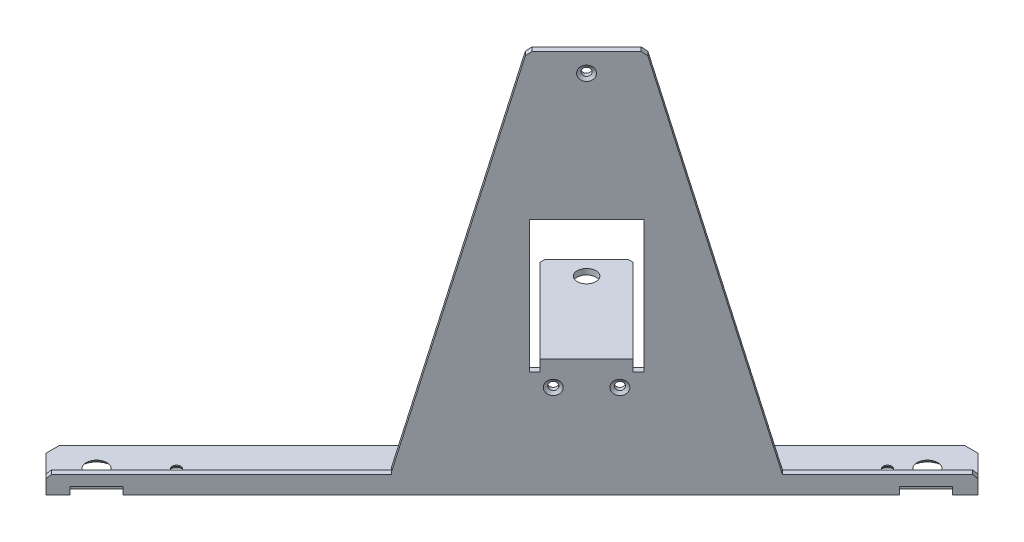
ISO-10303-21;
HEADER;
FILE_DESCRIPTION(('STEP AP214'),'2;1');
FILE_NAME('part.step','',(''),(''),'','','');
FILE_SCHEMA(('AUTOMOTIVE_DESIGN { 1 0 10303 214 1 1 1 1 }'));
ENDSEC;
DATA;
#1=APPLICATION_CONTEXT('core data for automotive mechanical design processes');
#2=APPLICATION_PROTOCOL_DEFINITION('international standard','automotive_design',2000,#1);
#3=PRODUCT_CONTEXT('',#1,'mechanical');
#4=PRODUCT('Part','Part','',(#3));
#5=PRODUCT_RELATED_PRODUCT_CATEGORY('part','',(#4));
#6=PRODUCT_DEFINITION_FORMATION('','',#4);
#7=PRODUCT_DEFINITION_CONTEXT('part definition',#1,'design');
#8=PRODUCT_DEFINITION('design','',#6,#7);
#9=PRODUCT_DEFINITION_SHAPE('','',#8);
#10=(LENGTH_UNIT() NAMED_UNIT(*) SI_UNIT(.MILLI.,.METRE.));
#11=(NAMED_UNIT(*) PLANE_ANGLE_UNIT() SI_UNIT($,.RADIAN.));
#12=(NAMED_UNIT(*) SI_UNIT($,.STERADIAN.) SOLID_ANGLE_UNIT());
#13=UNCERTAINTY_MEASURE_WITH_UNIT(LENGTH_MEASURE(1.E-05),#10,'distance_accuracy_value','');
#14=(GEOMETRIC_REPRESENTATION_CONTEXT(3) GLOBAL_UNCERTAINTY_ASSIGNED_CONTEXT((#13)) GLOBAL_UNIT_ASSIGNED_CONTEXT((#10,
#11,#12)) REPRESENTATION_CONTEXT('',''));
#15=CARTESIAN_POINT('',(0.,0.,0.));
#16=DIRECTION('',(0.,0.,1.));
#17=DIRECTION('',(1.,0.,0.));
#18=AXIS2_PLACEMENT_3D('',#15,#16,#17);
#19=CARTESIAN_POINT('',(410.911132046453,-134.679187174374,10.6066017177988));
#20=DIRECTION('',(0.,-1.,0.));
#21=DIRECTION('',(0.,0.,-1.));
#22=AXIS2_PLACEMENT_3D('',#19,#20,#21);
#23=CYLINDRICAL_SURFACE('',#22,2.24999999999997);
#24=CARTESIAN_POINT('',(410.911132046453,-131.679187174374,10.6066017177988));
#25=DIRECTION('',(0.,-1.,0.));
#26=DIRECTION('',(0.,0.,-1.));
#27=AXIS2_PLACEMENT_3D('',#24,#25,#26);
#28=CIRCLE('',#27,2.24999999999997);
#29=CARTESIAN_POINT('',(410.911132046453,-131.679187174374,8.35660171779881));
#30=VERTEX_POINT('',#29);
#31=EDGE_CURVE('E377',#30,#30,#28,.F.);
#32=ORIENTED_EDGE('',*,*,#31,.T.);
#33=EDGE_LOOP('',(#32));
#34=FACE_BOUND('',#33,.T.);
#35=CARTESIAN_POINT('',(410.911132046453,-132.229187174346,10.6066017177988));
#36=DIRECTION('',(0.,-1.,0.));
#37=DIRECTION('',(0.,0.,-1.));
#38=AXIS2_PLACEMENT_3D('',#35,#36,#37);
#39=CIRCLE('',#38,2.24999999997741);
#40=CARTESIAN_POINT('',(410.911132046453,-132.229187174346,8.35660171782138));
#41=VERTEX_POINT('',#40);
#42=EDGE_CURVE('E315',#41,#41,#39,.T.);
#43=ORIENTED_EDGE('',*,*,#42,.T.);
#44=EDGE_LOOP('',(#43));
#45=FACE_BOUND('',#44,.T.);
#46=ADVANCED_FACE('F16',(#34,#45),#23,.F.);
#47=CARTESIAN_POINT('',(222.113621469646,-134.679187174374,199.404112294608));
#48=DIRECTION('',(0.,-1.,0.));
#49=DIRECTION('',(0.,0.,-1.));
#50=AXIS2_PLACEMENT_3D('',#47,#48,#49);
#51=CYLINDRICAL_SURFACE('',#50,2.24999999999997);
#52=CARTESIAN_POINT('',(222.113621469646,-131.679187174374,199.404112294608));
#53=DIRECTION('',(0.,-1.,0.));
#54=DIRECTION('',(0.,0.,-1.));
#55=AXIS2_PLACEMENT_3D('',#52,#53,#54);
#56=CIRCLE('',#55,2.24999999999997);
#57=CARTESIAN_POINT('',(222.113621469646,-131.679187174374,197.154112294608));
#58=VERTEX_POINT('',#57);
#59=EDGE_CURVE('E374',#58,#58,#56,.F.);
#60=ORIENTED_EDGE('',*,*,#59,.T.);
#61=EDGE_LOOP('',(#60));
#62=FACE_BOUND('',#61,.T.);
#63=CARTESIAN_POINT('',(222.113621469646,-132.229187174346,199.404112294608));
#64=DIRECTION('',(0.,-1.,0.));
#65=DIRECTION('',(0.,0.,-1.));
#66=AXIS2_PLACEMENT_3D('',#63,#64,#65);
#67=CIRCLE('',#66,2.25000000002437);
#68=CARTESIAN_POINT('',(222.113621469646,-132.229187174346,197.154112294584));
#69=VERTEX_POINT('',#68);
#70=EDGE_CURVE('E312',#69,#69,#67,.T.);
#71=ORIENTED_EDGE('',*,*,#70,.T.);
#72=EDGE_LOOP('',(#71));
#73=FACE_BOUND('',#72,.T.);
#74=ADVANCED_FACE('F1200',(#62,#73),#51,.F.);
#75=CARTESIAN_POINT('',(304.491561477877,-129.579187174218,112.07642481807));
#76=DIRECTION('',(0.,1.,0.));
#77=DIRECTION('',(-1.,0.,0.));
#78=AXIS2_PLACEMENT_3D('',#75,#76,#77);
#79=CYLINDRICAL_SURFACE('',#78,2.09999999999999);
#80=CARTESIAN_POINT('',(304.491561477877,-133.726559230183,112.076424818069));
#81=DIRECTION('',(0.,-1.,0.));
#82=DIRECTION('',(0.,0.,-1.));
#83=AXIS2_PLACEMENT_3D('',#80,#81,#82);
#84=CIRCLE('',#83,2.09999999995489);
#85=CARTESIAN_POINT('',(304.491561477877,-133.726559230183,109.976424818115));
#86=VERTEX_POINT('',#85);
#87=EDGE_CURVE('E309',#86,#86,#84,.T.);
#88=ORIENTED_EDGE('',*,*,#87,.T.);
#89=EDGE_LOOP('',(#88));
#90=FACE_BOUND('',#89,.T.);
#91=CARTESIAN_POINT('',(304.491561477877,-131.679187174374,112.07642481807));
#92=DIRECTION('',(0.,1.,0.));
#93=DIRECTION('',(-1.,0.,0.));
#94=AXIS2_PLACEMENT_3D('',#91,#92,#93);
#95=CIRCLE('',#94,2.09999999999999);
#96=CARTESIAN_POINT('',(302.391561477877,-131.679187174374,112.07642481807));
#97=VERTEX_POINT('',#96);
#98=EDGE_CURVE('E370',#97,#97,#95,.T.);
#99=ORIENTED_EDGE('',*,*,#98,.T.);
#100=EDGE_LOOP('',(#99));
#101=FACE_BOUND('',#100,.T.);
#102=ADVANCED_FACE('F1192',(#90,#101),#79,.F.);
#103=CARTESIAN_POINT('',(352.574822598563,-129.579187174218,63.9931636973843));
#104=DIRECTION('',(0.,1.,0.));
#105=DIRECTION('',(-1.,0.,0.));
#106=AXIS2_PLACEMENT_3D('',#103,#104,#105);
#107=CYLINDRICAL_SURFACE('',#106,2.09999999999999);
#108=CARTESIAN_POINT('',(352.574822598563,-133.72655923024,63.9931636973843));
#109=DIRECTION('',(0.,-1.,0.));
#110=DIRECTION('',(1.,0.,0.));
#111=AXIS2_PLACEMENT_3D('',#108,#109,#110);
#112=CIRCLE('',#111,2.09999999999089);
#113=CARTESIAN_POINT('',(354.674822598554,-133.72655923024,63.9931636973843));
#114=VERTEX_POINT('',#113);
#115=EDGE_CURVE('E305',#114,#114,#112,.T.);
#116=ORIENTED_EDGE('',*,*,#115,.T.);
#117=EDGE_LOOP('',(#116));
#118=FACE_BOUND('',#117,.T.);
#119=CARTESIAN_POINT('',(352.574822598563,-131.679187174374,63.9931636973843));
#120=DIRECTION('',(0.,1.,0.));
#121=DIRECTION('',(-1.,0.,0.));
#122=AXIS2_PLACEMENT_3D('',#119,#120,#121);
#123=CIRCLE('',#122,2.09999999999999);
#124=CARTESIAN_POINT('',(350.474822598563,-131.679187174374,63.9931636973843));
#125=VERTEX_POINT('',#124);
#126=EDGE_CURVE('E367',#125,#125,#123,.T.);
#127=ORIENTED_EDGE('',*,*,#126,.T.);
#128=EDGE_LOOP('',(#127));
#129=FACE_BOUND('',#128,.T.);
#130=ADVANCED_FACE('F1184',(#118,#129),#107,.F.);
#131=CARTESIAN_POINT('',(302.016687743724,-72.1791871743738,61.5182899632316));
#132=DIRECTION('',(0.,1.,0.));
#133=DIRECTION('',(0.,0.,1.));
#134=AXIS2_PLACEMENT_3D('',#131,#132,#133);
#135=CYLINDRICAL_SURFACE('',#134,4.99999999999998);
#136=CARTESIAN_POINT('',(302.016687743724,-75.1791871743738,61.5182899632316));
#137=DIRECTION('',(0.,1.,0.));
#138=DIRECTION('',(0.,0.,1.));
#139=AXIS2_PLACEMENT_3D('',#136,#137,#138);
#140=CIRCLE('',#139,4.99999999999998);
#141=CARTESIAN_POINT('',(302.016687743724,-75.1791871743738,66.5182899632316));
#142=VERTEX_POINT('',#141);
#143=EDGE_CURVE('E19',#142,#142,#140,.F.);
#144=ORIENTED_EDGE('',*,*,#143,.T.);
#145=EDGE_LOOP('',(#144));
#146=FACE_BOUND('',#145,.T.);
#147=CARTESIAN_POINT('',(302.016687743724,-72.1791871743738,61.5182899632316));
#148=DIRECTION('',(0.,1.,0.));
#149=DIRECTION('',(0.,0.,1.));
#150=AXIS2_PLACEMENT_3D('',#147,#148,#149);
#151=CIRCLE('',#150,4.99999999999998);
#152=CARTESIAN_POINT('',(302.016687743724,-72.1791871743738,66.5182899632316));
#153=VERTEX_POINT('',#152);
#154=EDGE_CURVE('E345',#153,#153,#151,.F.);
#155=ORIENTED_EDGE('',*,*,#154,.F.);
#156=EDGE_LOOP('',(#155));
#157=FACE_BOUND('',#156,.T.);
#158=ADVANCED_FACE('F1177',(#146,#157),#135,.F.);
#159=CARTESIAN_POINT('',(297.774047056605,-72.1791871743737,42.7799602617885));
#160=DIRECTION('',(0.,0.,-1.));
#161=DIRECTION('',(-1.,0.,0.));
#162=AXIS2_PLACEMENT_3D('',#159,#160,#161);
#163=PLANE('',#162);
#164=DIRECTION('',(0.,1.,0.));
#165=VECTOR('',#164,1.);
#166=CARTESIAN_POINT('',(308.02709538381,-72.1791871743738,42.7799602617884));
#167=LINE('',#166,#165);
#168=CARTESIAN_POINT('',(308.02709538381,-72.1791871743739,42.7799602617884));
#169=VERTEX_POINT('',#168);
#170=CARTESIAN_POINT('',(308.02709538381,-75.1791871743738,42.7799602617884));
#171=VERTEX_POINT('',#170);
#172=EDGE_CURVE('E291',#169,#171,#167,.F.);
#173=ORIENTED_EDGE('',*,*,#172,.T.);
#174=DIRECTION('',(1.,0.,0.));
#175=VECTOR('',#174,1.);
#176=CARTESIAN_POINT('',(297.774047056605,-75.1791871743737,42.7799602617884));
#177=LINE('',#176,#175);
#178=CARTESIAN_POINT('',(305.198668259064,-75.1791871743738,42.7799602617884));
#179=VERTEX_POINT('',#178);
#180=EDGE_CURVE('E289',#171,#179,#177,.F.);
#181=ORIENTED_EDGE('',*,*,#180,.T.);
#182=DIRECTION('',(0.,1.,0.));
#183=VECTOR('',#182,1.);
#184=CARTESIAN_POINT('',(305.198668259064,-72.1791871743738,42.7799602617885));
#185=LINE('',#184,#183);
#186=CARTESIAN_POINT('',(305.198668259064,-72.1791871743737,42.7799602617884));
#187=VERTEX_POINT('',#186);
#188=EDGE_CURVE('E279',#179,#187,#185,.T.);
#189=ORIENTED_EDGE('',*,*,#188,.T.);
#190=DIRECTION('',(1.,0.,0.));
#191=VECTOR('',#190,1.);
#192=CARTESIAN_POINT('',(297.774047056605,-72.1791871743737,42.7799602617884));
#193=LINE('',#192,#191);
#194=EDGE_CURVE('E407',#169,#187,#193,.F.);
#195=ORIENTED_EDGE('',*,*,#194,.F.);
#196=EDGE_LOOP('',(#173,#181,#189,#195));
#197=FACE_BOUND('',#196,.T.);
#198=ADVANCED_FACE('F290',(#197),#163,.T.);
#199=CARTESIAN_POINT('',(281.157037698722,-72.1791871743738,66.8215908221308));
#200=DIRECTION('',(0.707106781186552,0.,0.707106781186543));
#201=DIRECTION('',(0.707106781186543,0.,-0.707106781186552));
#202=AXIS2_PLACEMENT_3D('',#199,#200,#201);
#203=PLANE('',#202);
#204=DIRECTION('',(0.,1.,0.));
#205=VECTOR('',#204,1.);
#206=CARTESIAN_POINT('',(283.278358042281,-72.1791871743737,64.7002704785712));
#207=LINE('',#206,#205);
#208=CARTESIAN_POINT('',(283.278358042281,-75.1791871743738,64.7002704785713));
#209=VERTEX_POINT('',#208);
#210=CARTESIAN_POINT('',(283.278358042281,-72.1791871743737,64.7002704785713));
#211=VERTEX_POINT('',#210);
#212=EDGE_CURVE('E294',#209,#211,#207,.T.);
#213=ORIENTED_EDGE('',*,*,#212,.T.);
#214=DIRECTION('',(-0.707106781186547,0.,0.707106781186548));
#215=VECTOR('',#214,1.);
#216=CARTESIAN_POINT('',(305.198668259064,-72.1791871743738,42.7799602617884));
#217=LINE('',#216,#215);
#218=EDGE_CURVE('E283',#187,#211,#217,.T.);
#219=ORIENTED_EDGE('',*,*,#218,.F.);
#220=ORIENTED_EDGE('',*,*,#188,.F.);
#221=DIRECTION('',(-0.70710678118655,0.,0.707106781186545));
#222=VECTOR('',#221,1.);
#223=CARTESIAN_POINT('',(305.198668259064,-75.1791871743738,42.7799602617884));
#224=LINE('',#223,#222);
#225=EDGE_CURVE('E276',#179,#209,#224,.T.);
#226=ORIENTED_EDGE('',*,*,#225,.T.);
#227=EDGE_LOOP('',(#213,#219,#220,#226));
#228=FACE_BOUND('',#227,.T.);
#229=ADVANCED_FACE('F281',(#228),#203,.F.);
#230=CARTESIAN_POINT('',(297.774047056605,-75.1791871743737,28.9913780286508));
#231=DIRECTION('',(0.,1.,0.));
#232=DIRECTION('',(0.,0.,1.));
#233=AXIS2_PLACEMENT_3D('',#230,#231,#232);
#234=PLANE('',#233);
#235=DIRECTION('',(0.707106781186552,0.,0.707106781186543));
#236=VECTOR('',#235,1.);
#237=CARTESIAN_POINT('',(306.612881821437,-75.1791871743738,41.3657466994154));
#238=LINE('',#237,#236);
#239=CARTESIAN_POINT('',(350.453502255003,-75.1791871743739,85.2063671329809));
#240=VERTEX_POINT('',#239);
#241=EDGE_CURVE('E414',#171,#240,#238,.T.);
#242=ORIENTED_EDGE('',*,*,#241,.T.);
#243=DIRECTION('',(0.707106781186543,0.,-0.707106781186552));
#244=VECTOR('',#243,1.);
#245=CARTESIAN_POINT('',(391.11214217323,-75.1791871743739,44.5477272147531));
#246=LINE('',#245,#244);
#247=CARTESIAN_POINT('',(325.704764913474,-75.1791871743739,109.95510447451));
#248=VERTEX_POINT('',#247);
#249=EDGE_CURVE('E359',#240,#248,#246,.F.);
#250=ORIENTED_EDGE('',*,*,#249,.T.);
#251=DIRECTION('',(-0.707106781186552,0.,-0.707106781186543));
#252=VECTOR('',#251,1.);
#253=CARTESIAN_POINT('',(327.826085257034,-75.179187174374,112.07642481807));
#254=LINE('',#253,#252);
#255=CARTESIAN_POINT('',(283.278358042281,-75.1791871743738,67.5286976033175));
#256=VERTEX_POINT('',#255);
#257=EDGE_CURVE('E524',#248,#256,#254,.T.);
#258=ORIENTED_EDGE('',*,*,#257,.T.);
#259=DIRECTION('',(0.,0.,1.));
#260=VECTOR('',#259,1.);
#261=CARTESIAN_POINT('',(283.278358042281,-75.1791871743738,28.9913780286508));
#262=LINE('',#261,#260);
#263=EDGE_CURVE('E299',#256,#209,#262,.F.);
#264=ORIENTED_EDGE('',*,*,#263,.T.);
#265=ORIENTED_EDGE('',*,*,#225,.F.);
#266=ORIENTED_EDGE('',*,*,#180,.F.);
#267=EDGE_LOOP('',(#242,#250,#258,#264,#265,#266));
#268=FACE_BOUND('',#267,.T.);
#269=ORIENTED_EDGE('',*,*,#143,.F.);
#270=EDGE_LOOP('',(#269));
#271=FACE_BOUND('',#270,.T.);
#272=ADVANCED_FACE('F296',(#268,#271),#234,.F.);
#273=CARTESIAN_POINT('',(283.278358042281,-72.1791871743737,28.9913780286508));
#274=DIRECTION('',(1.,0.,0.));
#275=DIRECTION('',(0.,1.,0.));
#276=AXIS2_PLACEMENT_3D('',#273,#274,#275);
#277=PLANE('',#276);
#278=DIRECTION('',(0.,1.,0.));
#279=VECTOR('',#278,1.);
#280=CARTESIAN_POINT('',(283.278358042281,-78.179187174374,67.5286976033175));
#281=LINE('',#280,#279);
#282=CARTESIAN_POINT('',(283.278358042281,-72.1791871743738,67.5286976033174));
#283=VERTEX_POINT('',#282);
#284=EDGE_CURVE('E399',#256,#283,#281,.T.);
#285=ORIENTED_EDGE('',*,*,#284,.T.);
#286=DIRECTION('',(0.,0.,1.));
#287=VECTOR('',#286,1.);
#288=CARTESIAN_POINT('',(283.278358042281,-72.1791871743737,28.9913780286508));
#289=LINE('',#288,#287);
#290=EDGE_CURVE('E396',#211,#283,#289,.T.);
#291=ORIENTED_EDGE('',*,*,#290,.F.);
#292=ORIENTED_EDGE('',*,*,#212,.F.);
#293=ORIENTED_EDGE('',*,*,#263,.F.);
#294=EDGE_LOOP('',(#285,#291,#292,#293));
#295=FACE_BOUND('',#294,.T.);
#296=ADVANCED_FACE('F397',(#295),#277,.F.);
#297=CARTESIAN_POINT('',(288.457919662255,-130.679187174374,151.444590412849));
#298=DIRECTION('',(-0.707106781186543,0.,0.707106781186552));
#299=DIRECTION('',(0.707106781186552,0.,0.707106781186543));
#300=AXIS2_PLACEMENT_3D('',#297,#298,#299);
#301=PLANE('',#300);
#302=DIRECTION('',(-0.707106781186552,0.,-0.707106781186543));
#303=VECTOR('',#302,1.);
#304=CARTESIAN_POINT('',(288.457919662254,-123.726782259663,151.444590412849));
#305=LINE('',#304,#303);
#306=CARTESIAN_POINT('',(288.457919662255,-123.726782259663,151.444590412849));
#307=VERTEX_POINT('',#306);
#308=CARTESIAN_POINT('',(286.336599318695,-123.726782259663,149.32327006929));
#309=VERTEX_POINT('',#308);
#310=EDGE_CURVE('E492',#307,#309,#305,.T.);
#311=ORIENTED_EDGE('',*,*,#310,.T.);
#312=DIRECTION('',(0.,1.,0.));
#313=VECTOR('',#312,1.);
#314=CARTESIAN_POINT('',(286.336599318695,-130.679187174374,149.323270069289));
#315=LINE('',#314,#313);
#316=CARTESIAN_POINT('',(286.336599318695,-125.179187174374,149.323270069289));
#317=VERTEX_POINT('',#316);
#318=EDGE_CURVE('E429',#309,#317,#315,.F.);
#319=ORIENTED_EDGE('',*,*,#318,.T.);
#320=DIRECTION('',(0.707106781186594,0.,0.707106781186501));
#321=VECTOR('',#320,1.);
#322=CARTESIAN_POINT('',(286.336599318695,-125.179187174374,149.32327006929));
#323=LINE('',#322,#321);
#324=CARTESIAN_POINT('',(288.457919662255,-125.179187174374,151.444590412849));
#325=VERTEX_POINT('',#324);
#326=EDGE_CURVE('E484',#317,#325,#323,.T.);
#327=ORIENTED_EDGE('',*,*,#326,.T.);
#328=DIRECTION('',(0.,1.,0.));
#329=VECTOR('',#328,1.);
#330=CARTESIAN_POINT('',(288.457919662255,-130.679187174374,151.444590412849));
#331=LINE('',#330,#329);
#332=EDGE_CURVE('E317',#325,#307,#331,.T.);
#333=ORIENTED_EDGE('',*,*,#332,.T.);
#334=EDGE_LOOP('',(#311,#319,#327,#333));
#335=FACE_BOUND('',#334,.T.);
#336=ADVANCED_FACE('F731',(#335),#301,.T.);
#337=CARTESIAN_POINT('',(410.911132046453,-134.679187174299,10.6066017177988));
#338=DIRECTION('',(0.,-1.,0.));
#339=DIRECTION('',(0.,0.,-1.));
#340=AXIS2_PLACEMENT_3D('',#337,#338,#339);
#341=CONICAL_SURFACE('',#340,4.69999999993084,0.785398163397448);
#342=CARTESIAN_POINT('',(410.911132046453,-134.679187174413,10.6066017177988));
#343=DIRECTION('',(0.,-1.,0.));
#344=DIRECTION('',(0.,0.,-1.));
#345=AXIS2_PLACEMENT_3D('',#342,#343,#344);
#346=CIRCLE('',#345,4.70000000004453);
#347=CARTESIAN_POINT('',(410.911132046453,-134.679187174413,5.90660171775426));
#348=VERTEX_POINT('',#347);
#349=EDGE_CURVE('E341',#348,#348,#346,.F.);
#350=ORIENTED_EDGE('',*,*,#349,.F.);
#351=EDGE_LOOP('',(#350));
#352=FACE_BOUND('',#351,.T.);
#353=ORIENTED_EDGE('',*,*,#42,.F.);
#354=EDGE_LOOP('',(#353));
#355=FACE_BOUND('',#354,.T.);
#356=ADVANCED_FACE('F1138',(#352,#355),#341,.F.);
#357=CARTESIAN_POINT('',(222.113621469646,-134.679187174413,199.404112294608));
#358=DIRECTION('',(0.,-1.,0.));
#359=DIRECTION('',(0.,0.,-1.));
#360=AXIS2_PLACEMENT_3D('',#357,#358,#359);
#361=CONICAL_SURFACE('',#360,4.70000000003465,0.785398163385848);
#362=CARTESIAN_POINT('',(222.113621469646,-134.679187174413,199.404112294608));
#363=DIRECTION('',(0.,-1.,0.));
#364=DIRECTION('',(0.,0.,-1.));
#365=AXIS2_PLACEMENT_3D('',#362,#363,#364);
#366=CIRCLE('',#365,4.70000000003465);
#367=CARTESIAN_POINT('',(222.113621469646,-134.679187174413,194.704112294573));
#368=VERTEX_POINT('',#367);
#369=EDGE_CURVE('E338',#368,#368,#366,.F.);
#370=ORIENTED_EDGE('',*,*,#369,.F.);
#371=EDGE_LOOP('',(#370));
#372=FACE_BOUND('',#371,.T.);
#373=ORIENTED_EDGE('',*,*,#70,.F.);
#374=EDGE_LOOP('',(#373));
#375=FACE_BOUND('',#374,.T.);
#376=ADVANCED_FACE('F1130',(#372,#375),#361,.F.);
#377=CARTESIAN_POINT('',(304.491561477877,-134.679187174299,112.076424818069));
#378=DIRECTION('',(0.,-1.,0.));
#379=DIRECTION('',(0.,0.,-1.));
#380=AXIS2_PLACEMENT_3D('',#377,#378,#379);
#381=CONICAL_SURFACE('',#380,3.74999999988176,1.04719755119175);
#382=ORIENTED_EDGE('',*,*,#87,.F.);
#383=EDGE_LOOP('',(#382));
#384=FACE_BOUND('',#383,.T.);
#385=CARTESIAN_POINT('',(304.491561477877,-134.679187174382,112.076424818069));
#386=DIRECTION('',(0.,-1.,0.));
#387=DIRECTION('',(0.,0.,-1.));
#388=AXIS2_PLACEMENT_3D('',#385,#386,#387);
#389=CIRCLE('',#388,3.75000000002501);
#390=CARTESIAN_POINT('',(304.491561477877,-134.679187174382,108.326424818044));
#391=VERTEX_POINT('',#390);
#392=EDGE_CURVE('E335',#391,#391,#389,.F.);
#393=ORIENTED_EDGE('',*,*,#392,.F.);
#394=EDGE_LOOP('',(#393));
#395=FACE_BOUND('',#394,.T.);
#396=ADVANCED_FACE('F1122',(#384,#395),#381,.F.);
#397=CARTESIAN_POINT('',(352.574822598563,-134.67918717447,63.9931636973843));
#398=DIRECTION('',(0.,-1.,0.));
#399=DIRECTION('',(1.,0.,0.));
#400=AXIS2_PLACEMENT_3D('',#397,#398,#399);
#401=CONICAL_SURFACE('',#400,3.75000000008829,1.04719755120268);
#402=ORIENTED_EDGE('',*,*,#115,.F.);
#403=EDGE_LOOP('',(#402));
#404=FACE_BOUND('',#403,.T.);
#405=CARTESIAN_POINT('',(352.574822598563,-134.679187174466,63.9931636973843));
#406=DIRECTION('',(0.,-1.,0.));
#407=DIRECTION('',(1.,0.,0.));
#408=AXIS2_PLACEMENT_3D('',#405,#406,#407);
#409=CIRCLE('',#408,3.75000000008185);
#410=CARTESIAN_POINT('',(356.324822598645,-134.679187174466,63.9931636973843));
#411=VERTEX_POINT('',#410);
#412=EDGE_CURVE('E332',#411,#411,#409,.F.);
#413=ORIENTED_EDGE('',*,*,#412,.F.);
#414=EDGE_LOOP('',(#413));
#415=FACE_BOUND('',#414,.T.);
#416=ADVANCED_FACE('F1114',(#404,#415),#401,.F.);
#417=CARTESIAN_POINT('',(421.517733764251,-134.679187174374,4.16333634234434E-13));
#418=DIRECTION('',(0.,-1.,0.));
#419=DIRECTION('',(1.,0.,0.));
#420=AXIS2_PLACEMENT_3D('',#417,#418,#419);
#421=CONICAL_SURFACE('',#420,8.49999999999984,0.785398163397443);
#422=CARTESIAN_POINT('',(421.517733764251,-131.679187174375,4.21231676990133E-13));
#423=DIRECTION('',(0.,-1.,0.));
#424=DIRECTION('',(1.,0.,0.));
#425=AXIS2_PLACEMENT_3D('',#422,#423,#424);
#426=CIRCLE('',#425,5.50000000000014);
#427=CARTESIAN_POINT('',(427.017733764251,-131.679187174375,4.21231676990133E-13));
#428=VERTEX_POINT('',#427);
#429=EDGE_CURVE('E364',#428,#428,#426,.F.);
#430=ORIENTED_EDGE('',*,*,#429,.T.);
#431=EDGE_LOOP('',(#430));
#432=FACE_BOUND('',#431,.T.);
#433=CARTESIAN_POINT('',(421.517733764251,-134.679187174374,4.16333634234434E-13));
#434=DIRECTION('',(0.,-1.,0.));
#435=DIRECTION('',(1.,0.,0.));
#436=AXIS2_PLACEMENT_3D('',#433,#434,#435);
#437=CIRCLE('',#436,8.49999999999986);
#438=CARTESIAN_POINT('',(430.017733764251,-134.679187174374,4.16333634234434E-13));
#439=VERTEX_POINT('',#438);
#440=EDGE_CURVE('E329',#439,#439,#437,.F.);
#441=ORIENTED_EDGE('',*,*,#440,.F.);
#442=EDGE_LOOP('',(#441));
#443=FACE_BOUND('',#442,.T.);
#444=ADVANCED_FACE('F1106',(#432,#443),#421,.F.);
#445=CARTESIAN_POINT('',(200.90041803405,-134.679187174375,220.617315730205));
#446=DIRECTION('',(0.,-1.,0.));
#447=DIRECTION('',(0.,0.,-1.));
#448=AXIS2_PLACEMENT_3D('',#445,#446,#447);
#449=CONICAL_SURFACE('',#448,8.50000000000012,0.785398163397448);
#450=CARTESIAN_POINT('',(200.90041803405,-131.679187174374,220.617315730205));
#451=DIRECTION('',(0.,-1.,0.));
#452=DIRECTION('',(0.,0.,-1.));
#453=AXIS2_PLACEMENT_3D('',#450,#451,#452);
#454=CIRCLE('',#453,5.49999999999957);
#455=CARTESIAN_POINT('',(200.90041803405,-131.679187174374,215.117315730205));
#456=VERTEX_POINT('',#455);
#457=EDGE_CURVE('E360',#456,#456,#454,.F.);
#458=ORIENTED_EDGE('',*,*,#457,.T.);
#459=EDGE_LOOP('',(#458));
#460=FACE_BOUND('',#459,.T.);
#461=CARTESIAN_POINT('',(200.90041803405,-134.679187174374,220.617315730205));
#462=DIRECTION('',(0.,-1.,0.));
#463=DIRECTION('',(0.,0.,-1.));
#464=AXIS2_PLACEMENT_3D('',#461,#462,#463);
#465=CIRCLE('',#464,8.50000000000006);
#466=CARTESIAN_POINT('',(200.90041803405,-134.679187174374,212.117315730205));
#467=VERTEX_POINT('',#466);
#468=EDGE_CURVE('E325',#467,#467,#465,.F.);
#469=ORIENTED_EDGE('',*,*,#468,.F.);
#470=EDGE_LOOP('',(#469));
#471=FACE_BOUND('',#470,.T.);
#472=ADVANCED_FACE('F1099',(#460,#471),#449,.F.);
#473=CARTESIAN_POINT('',(434.669919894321,-136.779187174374,-0.282842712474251));
#474=DIRECTION('',(0.707106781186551,0.,0.707106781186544));
#475=DIRECTION('',(0.707106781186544,0.,-0.707106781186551));
#476=AXIS2_PLACEMENT_3D('',#473,#474,#475);
#477=PLANE('',#476);
#478=DIRECTION('',(0.,1.,0.));
#479=VECTOR('',#478,1.);
#480=CARTESIAN_POINT('',(434.669919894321,-136.779187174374,-0.282842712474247));
#481=LINE('',#480,#479);
#482=CARTESIAN_POINT('',(434.669919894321,-134.679187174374,-0.282842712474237));
#483=VERTEX_POINT('',#482);
#484=CARTESIAN_POINT('',(434.669919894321,-131.679187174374,-0.282842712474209));
#485=VERTEX_POINT('',#484);
#486=EDGE_CURVE('E654',#483,#485,#481,.T.);
#487=ORIENTED_EDGE('',*,*,#486,.T.);
#488=DIRECTION('',(-0.707106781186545,0.,0.70710678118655));
#489=VECTOR('',#488,1.);
#490=CARTESIAN_POINT('',(434.669919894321,-131.679187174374,-0.282842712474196));
#491=LINE('',#490,#489);
#492=CARTESIAN_POINT('',(420.52778427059,-131.679187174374,13.8592929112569));
#493=VERTEX_POINT('',#492);
#494=EDGE_CURVE('E373',#485,#493,#491,.T.);
#495=ORIENTED_EDGE('',*,*,#494,.T.);
#496=DIRECTION('',(0.,1.,0.));
#497=VECTOR('',#496,1.);
#498=CARTESIAN_POINT('',(420.52778427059,-130.779187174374,13.8592929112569));
#499=LINE('',#498,#497);
#500=CARTESIAN_POINT('',(420.52778427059,-134.679187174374,13.8592929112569));
#501=VERTEX_POINT('',#500);
#502=EDGE_CURVE('E660',#493,#501,#499,.F.);
#503=ORIENTED_EDGE('',*,*,#502,.T.);
#504=DIRECTION('',(-0.707106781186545,0.,0.70710678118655));
#505=VECTOR('',#504,1.);
#506=CARTESIAN_POINT('',(434.669919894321,-134.679187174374,-0.282842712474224));
#507=LINE('',#506,#505);
#508=EDGE_CURVE('E644',#483,#501,#507,.T.);
#509=ORIENTED_EDGE('',*,*,#508,.F.);
#510=EDGE_LOOP('',(#487,#495,#503,#509));
#511=FACE_BOUND('',#510,.T.);
#512=ADVANCED_FACE('F767',(#511),#477,.T.);
#513=CARTESIAN_POINT('',(200.264021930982,-136.779187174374,234.123055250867));
#514=DIRECTION('',(-0.707106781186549,0.,-0.707106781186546));
#515=DIRECTION('',(-0.707106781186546,0.,0.707106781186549));
#516=AXIS2_PLACEMENT_3D('',#513,#514,#515);
#517=PLANE('',#516);
#518=DIRECTION('',(-0.707106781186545,0.,0.70710678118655));
#519=VECTOR('',#518,1.);
#520=CARTESIAN_POINT('',(214.406157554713,-131.679187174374,219.980919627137));
#521=LINE('',#520,#519);
#522=CARTESIAN_POINT('',(214.406157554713,-131.679187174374,219.980919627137));
#523=VERTEX_POINT('',#522);
#524=CARTESIAN_POINT('',(200.264021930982,-131.679187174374,234.123055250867));
#525=VERTEX_POINT('',#524);
#526=EDGE_CURVE('E376',#523,#525,#521,.T.);
#527=ORIENTED_EDGE('',*,*,#526,.T.);
#528=DIRECTION('',(0.,1.,0.));
#529=VECTOR('',#528,1.);
#530=CARTESIAN_POINT('',(200.264021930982,-136.779187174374,234.123055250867));
#531=LINE('',#530,#529);
#532=CARTESIAN_POINT('',(200.264021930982,-134.679187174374,234.123055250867));
#533=VERTEX_POINT('',#532);
#534=EDGE_CURVE('E449',#533,#525,#531,.T.);
#535=ORIENTED_EDGE('',*,*,#534,.F.);
#536=DIRECTION('',(-0.707106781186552,0.,0.707106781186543));
#537=VECTOR('',#536,1.);
#538=CARTESIAN_POINT('',(214.406157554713,-134.679187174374,219.980919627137));
#539=LINE('',#538,#537);
#540=CARTESIAN_POINT('',(214.406157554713,-134.679187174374,219.980919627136));
#541=VERTEX_POINT('',#540);
#542=EDGE_CURVE('E637',#541,#533,#539,.T.);
#543=ORIENTED_EDGE('',*,*,#542,.F.);
#544=DIRECTION('',(0.,1.,0.));
#545=VECTOR('',#544,1.);
#546=CARTESIAN_POINT('',(214.406157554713,-130.779187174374,219.980919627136));
#547=LINE('',#546,#545);
#548=EDGE_CURVE('E451',#523,#541,#547,.F.);
#549=ORIENTED_EDGE('',*,*,#548,.F.);
#550=EDGE_LOOP('',(#527,#535,#543,#549));
#551=FACE_BOUND('',#550,.T.);
#552=ADVANCED_FACE('F446',(#551),#517,.F.);
#553=CARTESIAN_POINT('',(180.39432137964,-134.679187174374,244.658946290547));
#554=DIRECTION('',(1.,0.,0.));
#555=DIRECTION('',(0.,1.,0.));
#556=AXIS2_PLACEMENT_3D('',#553,#554,#555);
#557=PLANE('',#556);
#558=DIRECTION('',(0.,1.,0.));
#559=VECTOR('',#558,1.);
#560=CARTESIAN_POINT('',(180.39432137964,-134.679187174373,219.910208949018));
#561=LINE('',#560,#559);
#562=CARTESIAN_POINT('',(180.39432137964,-134.679187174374,219.910208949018));
#563=VERTEX_POINT('',#562);
#564=CARTESIAN_POINT('',(180.39432137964,-131.679187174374,219.910208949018));
#565=VERTEX_POINT('',#564);
#566=EDGE_CURVE('E308',#563,#565,#561,.T.);
#567=ORIENTED_EDGE('',*,*,#566,.F.);
#568=DIRECTION('',(0.,0.,1.));
#569=VECTOR('',#568,1.);
#570=CARTESIAN_POINT('',(180.39432137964,-134.679187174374,244.658946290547));
#571=LINE('',#570,#569);
#572=CARTESIAN_POINT('',(180.39432137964,-134.679187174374,226.981276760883));
#573=VERTEX_POINT('',#572);
#574=EDGE_CURVE('E630',#573,#563,#571,.F.);
#575=ORIENTED_EDGE('',*,*,#574,.F.);
#576=DIRECTION('',(0.,1.,0.));
#577=VECTOR('',#576,1.);
#578=CARTESIAN_POINT('',(180.39432137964,-134.679187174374,226.981276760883));
#579=LINE('',#578,#577);
#580=CARTESIAN_POINT('',(180.39432137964,-131.679187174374,226.981276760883));
#581=VERTEX_POINT('',#580);
#582=EDGE_CURVE('E478',#573,#581,#579,.T.);
#583=ORIENTED_EDGE('',*,*,#582,.T.);
#584=DIRECTION('',(0.,0.,1.));
#585=VECTOR('',#584,1.);
#586=CARTESIAN_POINT('',(180.39432137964,-131.679187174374,244.658946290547));
#587=LINE('',#586,#585);
#588=EDGE_CURVE('E440',#581,#565,#587,.F.);
#589=ORIENTED_EDGE('',*,*,#588,.T.);
#590=EDGE_LOOP('',(#567,#575,#583,#589));
#591=FACE_BOUND('',#590,.T.);
#592=ADVANCED_FACE('F837',(#591),#557,.F.);
#593=CARTESIAN_POINT('',(176.858787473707,-134.679187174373,223.445742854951));
#594=DIRECTION('',(-0.707106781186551,0.,-0.707106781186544));
#595=DIRECTION('',(-0.707106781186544,0.,0.707106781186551));
#596=AXIS2_PLACEMENT_3D('',#593,#594,#595);
#597=PLANE('',#596);
#598=ORIENTED_EDGE('',*,*,#566,.T.);
#599=DIRECTION('',(0.707106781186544,0.,-0.707106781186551));
#600=VECTOR('',#599,1.);
#601=CARTESIAN_POINT('',(180.39432137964,-131.679187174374,219.910208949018));
#602=LINE('',#601,#600);
#603=CARTESIAN_POINT('',(420.810626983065,-131.679187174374,-20.5060966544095));
#604=VERTEX_POINT('',#603);
#605=EDGE_CURVE('E439',#565,#604,#602,.T.);
#606=ORIENTED_EDGE('',*,*,#605,.T.);
#607=DIRECTION('',(0.,1.,0.));
#608=VECTOR('',#607,1.);
#609=CARTESIAN_POINT('',(420.810626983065,-134.679187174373,-20.5060966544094));
#610=LINE('',#609,#608);
#611=CARTESIAN_POINT('',(420.810626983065,-134.679187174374,-20.5060966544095));
#612=VERTEX_POINT('',#611);
#613=EDGE_CURVE('E379',#604,#612,#610,.F.);
#614=ORIENTED_EDGE('',*,*,#613,.T.);
#615=DIRECTION('',(0.707106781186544,0.,-0.707106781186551));
#616=VECTOR('',#615,1.);
#617=CARTESIAN_POINT('',(180.39432137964,-134.679187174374,219.910208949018));
#618=LINE('',#617,#616);
#619=EDGE_CURVE('E627',#563,#612,#618,.T.);
#620=ORIENTED_EDGE('',*,*,#619,.F.);
#621=EDGE_LOOP('',(#598,#606,#614,#620));
#622=FACE_BOUND('',#621,.T.);
#623=ADVANCED_FACE('F836',(#622),#597,.T.);
#624=CARTESIAN_POINT('',(198.071990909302,-134.679187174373,-20.5060966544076));
#625=DIRECTION('',(0.,0.,1.));
#626=DIRECTION('',(1.,0.,0.));
#627=AXIS2_PLACEMENT_3D('',#624,#625,#626);
#628=PLANE('',#627);
#629=DIRECTION('',(0.,1.,0.));
#630=VECTOR('',#629,1.);
#631=CARTESIAN_POINT('',(427.88169479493,-134.679187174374,-20.5060966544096));
#632=LINE('',#631,#630);
#633=CARTESIAN_POINT('',(427.88169479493,-134.679187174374,-20.5060966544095));
#634=VERTEX_POINT('',#633);
#635=CARTESIAN_POINT('',(427.88169479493,-131.679187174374,-20.5060966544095));
#636=VERTEX_POINT('',#635);
#637=EDGE_CURVE('E621',#634,#636,#632,.T.);
#638=ORIENTED_EDGE('',*,*,#637,.F.);
#639=DIRECTION('',(1.,0.,0.));
#640=VECTOR('',#639,1.);
#641=CARTESIAN_POINT('',(198.071990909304,-134.679187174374,-20.5060966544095));
#642=LINE('',#641,#640);
#643=EDGE_CURVE('E624',#612,#634,#642,.T.);
#644=ORIENTED_EDGE('',*,*,#643,.F.);
#645=ORIENTED_EDGE('',*,*,#613,.F.);
#646=DIRECTION('',(1.,0.,0.));
#647=VECTOR('',#646,1.);
#648=CARTESIAN_POINT('',(198.071990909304,-131.679187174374,-20.5060966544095));
#649=LINE('',#648,#647);
#650=EDGE_CURVE('E437',#604,#636,#649,.T.);
#651=ORIENTED_EDGE('',*,*,#650,.T.);
#652=EDGE_LOOP('',(#638,#644,#645,#651));
#653=FACE_BOUND('',#652,.T.);
#654=ADVANCED_FACE('F835',(#653),#628,.F.);
#655=CARTESIAN_POINT('',(198.071990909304,-131.679187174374,244.658946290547));
#656=DIRECTION('',(0.,-1.,0.));
#657=DIRECTION('',(1.,0.,0.));
#658=AXIS2_PLACEMENT_3D('',#655,#656,#657);
#659=PLANE('',#658);
#660=ORIENTED_EDGE('',*,*,#457,.F.);
#661=EDGE_LOOP('',(#660));
#662=FACE_BOUND('',#661,.T.);
#663=ORIENTED_EDGE('',*,*,#429,.F.);
#664=EDGE_LOOP('',(#663));
#665=FACE_BOUND('',#664,.T.);
#666=ORIENTED_EDGE('',*,*,#126,.F.);
#667=EDGE_LOOP('',(#666));
#668=FACE_BOUND('',#667,.T.);
#669=ORIENTED_EDGE('',*,*,#98,.F.);
#670=EDGE_LOOP('',(#669));
#671=FACE_BOUND('',#670,.T.);
#672=DIRECTION('',(0.707106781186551,0.,0.707106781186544));
#673=VECTOR('',#672,1.);
#674=CARTESIAN_POINT('',(420.52778427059,-131.679187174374,13.8592929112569));
#675=LINE('',#674,#673);
#676=CARTESIAN_POINT('',(421.164180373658,-131.679187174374,14.4956890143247));
#677=VERTEX_POINT('',#676);
#678=EDGE_CURVE('E662',#677,#493,#675,.F.);
#679=ORIENTED_EDGE('',*,*,#678,.T.);
#680=ORIENTED_EDGE('',*,*,#494,.F.);
#681=DIRECTION('',(-0.707106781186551,0.,-0.707106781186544));
#682=VECTOR('',#681,1.);
#683=CARTESIAN_POINT('',(434.669919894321,-131.679187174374,-0.282842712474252));
#684=LINE('',#683,#682);
#685=CARTESIAN_POINT('',(435.306315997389,-131.679187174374,0.353553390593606));
#686=VERTEX_POINT('',#685);
#687=EDGE_CURVE('E652',#485,#686,#684,.F.);
#688=ORIENTED_EDGE('',*,*,#687,.T.);
#689=DIRECTION('',(0.707106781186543,0.,-0.707106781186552));
#690=VECTOR('',#689,1.);
#691=CARTESIAN_POINT('',(391.11214217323,-131.679187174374,44.547727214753));
#692=LINE('',#691,#690);
#693=CARTESIAN_POINT('',(442.023830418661,-131.679187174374,-6.36396103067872));
#694=VERTEX_POINT('',#693);
#695=EDGE_CURVE('E431',#686,#694,#692,.T.);
#696=ORIENTED_EDGE('',*,*,#695,.T.);
#697=DIRECTION('',(-0.707106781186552,0.,-0.707106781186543));
#698=VECTOR('',#697,1.);
#699=CARTESIAN_POINT('',(444.145150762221,-131.679187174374,-4.24264068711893));
#700=LINE('',#699,#698);
#701=EDGE_CURVE('E618',#636,#694,#700,.F.);
#702=ORIENTED_EDGE('',*,*,#701,.F.);
#703=ORIENTED_EDGE('',*,*,#650,.F.);
#704=ORIENTED_EDGE('',*,*,#605,.F.);
#705=ORIENTED_EDGE('',*,*,#588,.F.);
#706=DIRECTION('',(-0.707106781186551,0.,-0.707106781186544));
#707=VECTOR('',#706,1.);
#708=CARTESIAN_POINT('',(198.071990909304,-131.679187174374,244.658946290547));
#709=LINE('',#708,#707);
#710=CARTESIAN_POINT('',(194.536457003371,-131.679187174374,241.123412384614));
#711=VERTEX_POINT('',#710);
#712=EDGE_CURVE('E476',#581,#711,#709,.F.);
#713=ORIENTED_EDGE('',*,*,#712,.T.);
#714=DIRECTION('',(0.707106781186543,0.,-0.707106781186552));
#715=VECTOR('',#714,1.);
#716=CARTESIAN_POINT('',(391.11214217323,-131.679187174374,44.547727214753));
#717=LINE('',#716,#715);
#718=CARTESIAN_POINT('',(200.90041803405,-131.679187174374,234.759451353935));
#719=VERTEX_POINT('',#718);
#720=EDGE_CURVE('E363',#711,#719,#717,.T.);
#721=ORIENTED_EDGE('',*,*,#720,.T.);
#722=DIRECTION('',(-0.70710678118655,0.,-0.707106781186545));
#723=VECTOR('',#722,1.);
#724=CARTESIAN_POINT('',(200.264021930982,-131.679187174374,234.123055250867));
#725=LINE('',#724,#723);
#726=EDGE_CURVE('E456',#525,#719,#725,.F.);
#727=ORIENTED_EDGE('',*,*,#726,.F.);
#728=ORIENTED_EDGE('',*,*,#526,.F.);
#729=DIRECTION('',(0.70710678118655,0.,0.707106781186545));
#730=VECTOR('',#729,1.);
#731=CARTESIAN_POINT('',(214.406157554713,-131.679187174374,219.980919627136));
#732=LINE('',#731,#730);
#733=CARTESIAN_POINT('',(215.042553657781,-131.679187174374,220.617315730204));
#734=VERTEX_POINT('',#733);
#735=EDGE_CURVE('E667',#734,#523,#732,.F.);
#736=ORIENTED_EDGE('',*,*,#735,.F.);
#737=DIRECTION('',(0.707106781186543,0.,-0.707106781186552));
#738=VECTOR('',#737,1.);
#739=CARTESIAN_POINT('',(391.11214217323,-131.679187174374,44.547727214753));
#740=LINE('',#739,#738);
#741=EDGE_CURVE('E433',#734,#677,#740,.T.);
#742=ORIENTED_EDGE('',*,*,#741,.T.);
#743=EDGE_LOOP('',(#679,#680,#688,#696,#702,#703,#704,#705,#713,#721,#727,#728,#736,#742));
#744=FACE_BOUND('',#743,.T.);
#745=ORIENTED_EDGE('',*,*,#59,.F.);
#746=EDGE_LOOP('',(#745));
#747=FACE_BOUND('',#746,.T.);
#748=ORIENTED_EDGE('',*,*,#31,.F.);
#749=EDGE_LOOP('',(#748));
#750=FACE_BOUND('',#749,.T.);
#751=ADVANCED_FACE('F458',(#662,#665,#668,#671,#744,#747,#750),#659,.F.);
#752=CARTESIAN_POINT('',(391.11214217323,-130.679187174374,44.547727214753));
#753=DIRECTION('',(0.707106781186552,0.,0.707106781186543));
#754=DIRECTION('',(0.707106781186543,0.,-0.707106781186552));
#755=AXIS2_PLACEMENT_3D('',#752,#753,#754);
#756=PLANE('',#755);
#757=CARTESIAN_POINT('',(338.079133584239,59.3208128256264,97.5807358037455));
#758=DIRECTION('',(-0.707106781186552,0.,-0.707106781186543));
#759=DIRECTION('',(-0.707106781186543,0.,0.707106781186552));
#760=AXIS2_PLACEMENT_3D('',#757,#758,#759);
#761=CIRCLE('',#760,2.1);
#762=CARTESIAN_POINT('',(336.594209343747,59.3208128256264,99.0656600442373));
#763=VERTEX_POINT('',#762);
#764=EDGE_CURVE('E350',#763,#763,#761,.F.);
#765=ORIENTED_EDGE('',*,*,#764,.T.);
#766=EDGE_LOOP('',(#765));
#767=FACE_BOUND('',#766,.T.);
#768=CARTESIAN_POINT('',(346.91796834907,-85.1791871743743,88.7419010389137));
#769=DIRECTION('',(-0.707106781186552,0.,-0.707106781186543));
#770=DIRECTION('',(-0.707106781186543,0.,0.707106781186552));
#771=AXIS2_PLACEMENT_3D('',#768,#769,#770);
#772=CIRCLE('',#771,2.1);
#773=CARTESIAN_POINT('',(345.433044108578,-85.1791871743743,90.2268252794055));
#774=VERTEX_POINT('',#773);
#775=EDGE_CURVE('E353',#774,#774,#772,.F.);
#776=ORIENTED_EDGE('',*,*,#775,.T.);
#777=EDGE_LOOP('',(#776));
#778=FACE_BOUND('',#777,.T.);
#779=CARTESIAN_POINT('',(329.240298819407,-85.1791871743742,106.419570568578));
#780=DIRECTION('',(-0.707106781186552,0.,-0.707106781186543));
#781=DIRECTION('',(-0.707106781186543,0.,0.707106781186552));
#782=AXIS2_PLACEMENT_3D('',#779,#780,#781);
#783=CIRCLE('',#782,2.1);
#784=CARTESIAN_POINT('',(327.755374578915,-85.1791871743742,107.90449480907));
#785=VERTEX_POINT('',#784);
#786=EDGE_CURVE('E356',#785,#785,#783,.F.);
#787=ORIENTED_EDGE('',*,*,#786,.T.);
#788=EDGE_LOOP('',(#787));
#789=FACE_BOUND('',#788,.T.);
#790=DIRECTION('',(0.,1.,0.));
#791=VECTOR('',#790,1.);
#792=CARTESIAN_POINT('',(350.453502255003,-72.1791871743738,85.2063671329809));
#793=LINE('',#792,#791);
#794=CARTESIAN_POINT('',(350.453502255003,-78.1791871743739,85.2063671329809));
#795=VERTEX_POINT('',#794);
#796=EDGE_CURVE('E349',#240,#795,#793,.F.);
#797=ORIENTED_EDGE('',*,*,#796,.T.);
#798=DIRECTION('',(0.707106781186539,0.,-0.707106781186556));
#799=VECTOR('',#798,1.);
#800=CARTESIAN_POINT('',(350.453502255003,-78.1791871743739,85.2063671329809));
#801=LINE('',#800,#799);
#802=CARTESIAN_POINT('',(353.281929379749,-78.1791871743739,82.3779400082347));
#803=VERTEX_POINT('',#802);
#804=EDGE_CURVE('E494',#795,#803,#801,.T.);
#805=ORIENTED_EDGE('',*,*,#804,.T.);
#806=DIRECTION('',(0.,1.,0.));
#807=VECTOR('',#806,1.);
#808=CARTESIAN_POINT('',(353.281929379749,-130.679187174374,82.3779400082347));
#809=LINE('',#808,#807);
#810=CARTESIAN_POINT('',(353.281929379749,-7.97918717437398,82.3779400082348));
#811=VERTEX_POINT('',#810);
#812=EDGE_CURVE('E502',#811,#803,#809,.F.);
#813=ORIENTED_EDGE('',*,*,#812,.F.);
#814=DIRECTION('',(-0.707106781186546,0.,0.707106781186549));
#815=VECTOR('',#814,1.);
#816=CARTESIAN_POINT('',(353.281929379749,-7.97918717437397,82.3779400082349));
#817=LINE('',#816,#815);
#818=CARTESIAN_POINT('',(322.876337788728,-7.97918717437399,112.783531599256));
#819=VERTEX_POINT('',#818);
#820=EDGE_CURVE('E507',#811,#819,#817,.T.);
#821=ORIENTED_EDGE('',*,*,#820,.T.);
#822=DIRECTION('',(0.,1.,0.));
#823=VECTOR('',#822,1.);
#824=CARTESIAN_POINT('',(322.876337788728,-130.679187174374,112.783531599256));
#825=LINE('',#824,#823);
#826=CARTESIAN_POINT('',(322.876337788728,-78.179187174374,112.783531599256));
#827=VERTEX_POINT('',#826);
#828=EDGE_CURVE('E512',#827,#819,#825,.T.);
#829=ORIENTED_EDGE('',*,*,#828,.F.);
#830=DIRECTION('',(0.707106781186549,0.,-0.707106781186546));
#831=VECTOR('',#830,1.);
#832=CARTESIAN_POINT('',(322.876337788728,-78.179187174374,112.783531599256));
#833=LINE('',#832,#831);
#834=CARTESIAN_POINT('',(325.704764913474,-78.179187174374,109.95510447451));
#835=VERTEX_POINT('',#834);
#836=EDGE_CURVE('E519',#827,#835,#833,.T.);
#837=ORIENTED_EDGE('',*,*,#836,.T.);
#838=DIRECTION('',(0.,1.,0.));
#839=VECTOR('',#838,1.);
#840=CARTESIAN_POINT('',(325.704764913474,-78.179187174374,109.95510447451));
#841=LINE('',#840,#839);
#842=EDGE_CURVE('E402',#835,#248,#841,.T.);
#843=ORIENTED_EDGE('',*,*,#842,.T.);
#844=ORIENTED_EDGE('',*,*,#249,.F.);
#845=EDGE_LOOP('',(#797,#805,#813,#821,#829,#837,#843,#844));
#846=FACE_BOUND('',#845,.T.);
#847=DIRECTION('',(0.707106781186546,0.,-0.707106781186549));
#848=VECTOR('',#847,1.);
#849=CARTESIAN_POINT('',(195.950670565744,-125.179187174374,239.709198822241));
#850=LINE('',#849,#848);
#851=CARTESIAN_POINT('',(195.950670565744,-125.179187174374,239.709198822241));
#852=VERTEX_POINT('',#851);
#853=EDGE_CURVE('E487',#852,#317,#850,.T.);
#854=ORIENTED_EDGE('',*,*,#853,.T.);
#855=ORIENTED_EDGE('',*,*,#318,.F.);
#856=DIRECTION('',(0.179533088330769,0.967230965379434,-0.179533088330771));
#857=VECTOR('',#856,1.);
#858=CARTESIAN_POINT('',(285.046124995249,-130.679187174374,150.613744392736));
#859=LINE('',#858,#857);
#860=CARTESIAN_POINT('',(321.810164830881,67.3863508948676,113.849704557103));
#861=VERTEX_POINT('',#860);
#862=EDGE_CURVE('E490',#309,#861,#859,.T.);
#863=ORIENTED_EDGE('',*,*,#862,.T.);
#864=DIRECTION('',(0.55988796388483,0.610778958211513,-0.559887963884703));
#865=VECTOR('',#864,1.);
#866=CARTESIAN_POINT('',(321.810164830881,67.3863508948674,113.849704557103));
#867=LINE('',#866,#865);
#868=CARTESIAN_POINT('',(323.583444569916,69.3208128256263,112.076424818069));
#869=VERTEX_POINT('',#868);
#870=EDGE_CURVE('E427',#861,#869,#867,.T.);
#871=ORIENTED_EDGE('',*,*,#870,.T.);
#872=DIRECTION('',(0.70710678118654,0.,-0.707106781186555));
#873=VECTOR('',#872,1.);
#874=CARTESIAN_POINT('',(323.583444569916,69.3208128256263,112.076424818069));
#875=LINE('',#874,#873);
#876=CARTESIAN_POINT('',(352.574822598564,69.3208128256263,83.0850467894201));
#877=VERTEX_POINT('',#876);
#878=EDGE_CURVE('E589',#869,#877,#875,.T.);
#879=ORIENTED_EDGE('',*,*,#878,.T.);
#880=DIRECTION('',(0.559887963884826,-0.61077895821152,-0.559887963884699));
#881=VECTOR('',#880,1.);
#882=CARTESIAN_POINT('',(352.574822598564,69.3208128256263,83.0850467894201));
#883=LINE('',#882,#881);
#884=CARTESIAN_POINT('',(354.348102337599,67.3863508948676,81.3117670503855));
#885=VERTEX_POINT('',#884);
#886=EDGE_CURVE('E596',#877,#885,#883,.T.);
#887=ORIENTED_EDGE('',*,*,#886,.T.);
#888=DIRECTION('',(-0.179533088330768,0.967230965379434,0.179533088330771));
#889=VECTOR('',#888,1.);
#890=CARTESIAN_POINT('',(353.989036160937,69.3208128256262,81.6708332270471));
#891=LINE('',#890,#889);
#892=CARTESIAN_POINT('',(390.091256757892,-125.179187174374,45.5686126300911));
#893=VERTEX_POINT('',#892);
#894=EDGE_CURVE('E598',#885,#893,#891,.F.);
#895=ORIENTED_EDGE('',*,*,#894,.T.);
#896=DIRECTION('',(-0.707106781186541,0.,0.707106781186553));
#897=VECTOR('',#896,1.);
#898=CARTESIAN_POINT('',(440.609616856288,-125.179187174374,-4.94974746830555));
#899=LINE('',#898,#897);
#900=CARTESIAN_POINT('',(440.609616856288,-125.179187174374,-4.94974746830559));
#901=VERTEX_POINT('',#900);
#902=EDGE_CURVE('E606',#901,#893,#899,.T.);
#903=ORIENTED_EDGE('',*,*,#902,.F.);
#904=DIRECTION('',(0.499999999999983,-0.707106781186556,-0.500000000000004));
#905=VECTOR('',#904,1.);
#906=CARTESIAN_POINT('',(440.609616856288,-125.179187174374,-4.94974746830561));
#907=LINE('',#906,#905);
#908=CARTESIAN_POINT('',(442.023830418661,-127.179187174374,-6.36396103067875));
#909=VERTEX_POINT('',#908);
#910=EDGE_CURVE('E610',#901,#909,#907,.T.);
#911=ORIENTED_EDGE('',*,*,#910,.T.);
#912=DIRECTION('',(0.,1.,0.));
#913=VECTOR('',#912,1.);
#914=CARTESIAN_POINT('',(442.023830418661,-134.679187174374,-6.36396103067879));
#915=LINE('',#914,#913);
#916=EDGE_CURVE('E615',#694,#909,#915,.T.);
#917=ORIENTED_EDGE('',*,*,#916,.F.);
#918=ORIENTED_EDGE('',*,*,#695,.F.);
#919=DIRECTION('',(0.,1.,0.));
#920=VECTOR('',#919,1.);
#921=CARTESIAN_POINT('',(435.306315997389,-136.779187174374,0.353553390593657));
#922=LINE('',#921,#920);
#923=CARTESIAN_POINT('',(435.306315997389,-130.779187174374,0.353553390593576));
#924=VERTEX_POINT('',#923);
#925=EDGE_CURVE('E650',#686,#924,#922,.T.);
#926=ORIENTED_EDGE('',*,*,#925,.T.);
#927=DIRECTION('',(-0.707106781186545,0.,0.70710678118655));
#928=VECTOR('',#927,1.);
#929=CARTESIAN_POINT('',(435.306315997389,-130.779187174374,0.353553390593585));
#930=LINE('',#929,#928);
#931=CARTESIAN_POINT('',(421.164180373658,-130.779187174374,14.4956890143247));
#932=VERTEX_POINT('',#931);
#933=EDGE_CURVE('E658',#924,#932,#930,.T.);
#934=ORIENTED_EDGE('',*,*,#933,.T.);
#935=DIRECTION('',(0.,1.,0.));
#936=VECTOR('',#935,1.);
#937=CARTESIAN_POINT('',(421.164180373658,-130.779187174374,14.4956890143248));
#938=LINE('',#937,#936);
#939=EDGE_CURVE('E664',#932,#677,#938,.F.);
#940=ORIENTED_EDGE('',*,*,#939,.T.);
#941=ORIENTED_EDGE('',*,*,#741,.F.);
#942=DIRECTION('',(0.,1.,0.));
#943=VECTOR('',#942,1.);
#944=CARTESIAN_POINT('',(215.042553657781,-130.779187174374,220.617315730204));
#945=LINE('',#944,#943);
#946=CARTESIAN_POINT('',(215.042553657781,-130.779187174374,220.617315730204));
#947=VERTEX_POINT('',#946);
#948=EDGE_CURVE('E669',#947,#734,#945,.F.);
#949=ORIENTED_EDGE('',*,*,#948,.F.);
#950=DIRECTION('',(0.707106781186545,0.,-0.70710678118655));
#951=VECTOR('',#950,1.);
#952=CARTESIAN_POINT('',(200.90041803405,-130.779187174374,234.759451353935));
#953=LINE('',#952,#951);
#954=CARTESIAN_POINT('',(200.90041803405,-130.779187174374,234.759451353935));
#955=VERTEX_POINT('',#954);
#956=EDGE_CURVE('E676',#955,#947,#953,.T.);
#957=ORIENTED_EDGE('',*,*,#956,.F.);
#958=DIRECTION('',(0.,1.,0.));
#959=VECTOR('',#958,1.);
#960=CARTESIAN_POINT('',(200.90041803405,-136.779187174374,234.759451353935));
#961=LINE('',#960,#959);
#962=EDGE_CURVE('E463',#719,#955,#961,.T.);
#963=ORIENTED_EDGE('',*,*,#962,.F.);
#964=ORIENTED_EDGE('',*,*,#720,.F.);
#965=DIRECTION('',(0.,1.,0.));
#966=VECTOR('',#965,1.);
#967=CARTESIAN_POINT('',(194.536457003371,-134.679187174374,241.123412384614));
#968=LINE('',#967,#966);
#969=CARTESIAN_POINT('',(194.536457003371,-127.179187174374,241.123412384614));
#970=VERTEX_POINT('',#969);
#971=EDGE_CURVE('E471',#711,#970,#968,.T.);
#972=ORIENTED_EDGE('',*,*,#971,.T.);
#973=DIRECTION('',(0.49999999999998,0.707106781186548,-0.500000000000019));
#974=VECTOR('',#973,1.);
#975=CARTESIAN_POINT('',(194.536457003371,-127.179187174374,241.123412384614));
#976=LINE('',#975,#974);
#977=EDGE_CURVE('E482',#970,#852,#976,.T.);
#978=ORIENTED_EDGE('',*,*,#977,.T.);
#979=EDGE_LOOP('',(#854,#855,#863,#871,#879,#887,#895,#903,#911,#917,#918,#926,#934,#940,#941,
#949,#957,#963,#964,#972,#978));
#980=FACE_BOUND('',#979,.T.);
#981=ADVANCED_FACE('F530',(#767,#778,#789,#846,#980),#756,.F.);
#982=CARTESIAN_POINT('',(327.755374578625,-85.1791871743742,104.934646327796));
#983=DIRECTION('',(-0.707106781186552,0.,-0.707106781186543));
#984=DIRECTION('',(-0.707106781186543,0.,0.707106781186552));
#985=AXIS2_PLACEMENT_3D('',#982,#983,#984);
#986=CYLINDRICAL_SURFACE('',#985,2.1);
#987=CARTESIAN_POINT('',(330.68800948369,-85.1791871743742,107.86728123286));
#988=DIRECTION('',(0.70710678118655,0.,0.707106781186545));
#989=DIRECTION('',(0.707106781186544,0.,-0.707106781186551));
#990=AXIS2_PLACEMENT_3D('',#987,#988,#989);
#991=CIRCLE('',#990,2.09999999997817);
#992=CARTESIAN_POINT('',(332.172933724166,-85.1791871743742,106.382356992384));
#993=VERTEX_POINT('',#992);
#994=EDGE_CURVE('E424',#993,#993,#991,.T.);
#995=ORIENTED_EDGE('',*,*,#994,.T.);
#996=EDGE_LOOP('',(#995));
#997=FACE_BOUND('',#996,.T.);
#998=ORIENTED_EDGE('',*,*,#786,.F.);
#999=EDGE_LOOP('',(#998));
#1000=FACE_BOUND('',#999,.T.);
#1001=ADVANCED_FACE('F925',(#997,#1000),#986,.F.);
#1002=CARTESIAN_POINT('',(345.433044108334,-85.1791871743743,87.2569767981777));
#1003=DIRECTION('',(-0.707106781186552,0.,-0.707106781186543));
#1004=DIRECTION('',(-0.707106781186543,0.,0.707106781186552));
#1005=AXIS2_PLACEMENT_3D('',#1002,#1003,#1004);
#1006=CYLINDRICAL_SURFACE('',#1005,2.1);
#1007=CARTESIAN_POINT('',(348.365679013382,-85.1791871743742,90.1896117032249));
#1008=DIRECTION('',(0.707106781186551,0.,0.707106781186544));
#1009=DIRECTION('',(0.707106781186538,0.,-0.707106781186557));
#1010=AXIS2_PLACEMENT_3D('',#1007,#1008,#1009);
#1011=CIRCLE('',#1010,2.09999999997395);
#1012=CARTESIAN_POINT('',(349.850603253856,-85.1791871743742,88.7046874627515));
#1013=VERTEX_POINT('',#1012);
#1014=EDGE_CURVE('E421',#1013,#1013,#1011,.T.);
#1015=ORIENTED_EDGE('',*,*,#1014,.T.);
#1016=EDGE_LOOP('',(#1015));
#1017=FACE_BOUND('',#1016,.T.);
#1018=ORIENTED_EDGE('',*,*,#775,.F.);
#1019=EDGE_LOOP('',(#1018));
#1020=FACE_BOUND('',#1019,.T.);
#1021=ADVANCED_FACE('F921',(#1017,#1020),#1006,.F.);
#1022=CARTESIAN_POINT('',(336.594209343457,59.3208128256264,96.095811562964));
#1023=DIRECTION('',(-0.707106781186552,0.,-0.707106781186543));
#1024=DIRECTION('',(-0.707106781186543,0.,0.707106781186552));
#1025=AXIS2_PLACEMENT_3D('',#1022,#1023,#1024);
#1026=CYLINDRICAL_SURFACE('',#1025,2.1);
#1027=CARTESIAN_POINT('',(339.52684424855,59.3208128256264,99.0284464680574));
#1028=DIRECTION('',(0.70710678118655,0.,0.707106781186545));
#1029=DIRECTION('',(0.707106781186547,0.,-0.707106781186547));
#1030=AXIS2_PLACEMENT_3D('',#1027,#1028,#1029);
#1031=CIRCLE('',#1030,2.10000000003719);
#1032=CARTESIAN_POINT('',(341.011768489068,59.3208128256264,97.5435222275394));
#1033=VERTEX_POINT('',#1032);
#1034=EDGE_CURVE('E417',#1033,#1033,#1031,.T.);
#1035=ORIENTED_EDGE('',*,*,#1034,.T.);
#1036=EDGE_LOOP('',(#1035));
#1037=FACE_BOUND('',#1036,.T.);
#1038=ORIENTED_EDGE('',*,*,#764,.F.);
#1039=EDGE_LOOP('',(#1038));
#1040=FACE_BOUND('',#1039,.T.);
#1041=ADVANCED_FACE('F918',(#1037,#1040),#1026,.F.);
#1042=CARTESIAN_POINT('',(306.612881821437,-72.1791871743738,41.3657466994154));
#1043=DIRECTION('',(-0.707106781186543,0.,0.707106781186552));
#1044=DIRECTION('',(0.707106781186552,0.,0.707106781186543));
#1045=AXIS2_PLACEMENT_3D('',#1042,#1043,#1044);
#1046=PLANE('',#1045);
#1047=DIRECTION('',(-0.707106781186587,0.,-0.707106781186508));
#1048=VECTOR('',#1047,1.);
#1049=CARTESIAN_POINT('',(352.574822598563,-78.1791871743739,87.3276874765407));
#1050=LINE('',#1049,#1048);
#1051=CARTESIAN_POINT('',(352.574822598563,-78.1791871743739,87.3276874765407));
#1052=VERTEX_POINT('',#1051);
#1053=EDGE_CURVE('E497',#1052,#795,#1050,.T.);
#1054=ORIENTED_EDGE('',*,*,#1053,.T.);
#1055=ORIENTED_EDGE('',*,*,#796,.F.);
#1056=ORIENTED_EDGE('',*,*,#241,.F.);
#1057=ORIENTED_EDGE('',*,*,#172,.F.);
#1058=DIRECTION('',(-0.707106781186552,0.,-0.707106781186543));
#1059=VECTOR('',#1058,1.);
#1060=CARTESIAN_POINT('',(352.574822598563,-72.179187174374,87.3276874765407));
#1061=LINE('',#1060,#1059);
#1062=CARTESIAN_POINT('',(352.574822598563,-72.179187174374,87.3276874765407));
#1063=VERTEX_POINT('',#1062);
#1064=EDGE_CURVE('E348',#1063,#169,#1061,.T.);
#1065=ORIENTED_EDGE('',*,*,#1064,.F.);
#1066=DIRECTION('',(0.,1.,0.));
#1067=VECTOR('',#1066,1.);
#1068=CARTESIAN_POINT('',(352.574822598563,-130.679187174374,87.3276874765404));
#1069=LINE('',#1068,#1067);
#1070=EDGE_CURVE('E420',#1052,#1063,#1069,.T.);
#1071=ORIENTED_EDGE('',*,*,#1070,.F.);
#1072=EDGE_LOOP('',(#1054,#1055,#1056,#1057,#1065,#1071));
#1073=FACE_BOUND('',#1072,.T.);
#1074=ADVANCED_FACE('F538',(#1073),#1046,.F.);
#1075=CARTESIAN_POINT('',(297.774047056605,-72.1791871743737,28.9913780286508));
#1076=DIRECTION('',(0.,1.,0.));
#1077=DIRECTION('',(0.,0.,1.));
#1078=AXIS2_PLACEMENT_3D('',#1075,#1076,#1077);
#1079=PLANE('',#1078);
#1080=DIRECTION('',(-0.707106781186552,0.,-0.707106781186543));
#1081=VECTOR('',#1080,1.);
#1082=CARTESIAN_POINT('',(327.826085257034,-72.1791871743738,112.07642481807));
#1083=LINE('',#1082,#1081);
#1084=CARTESIAN_POINT('',(327.826085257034,-72.1791871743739,112.07642481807));
#1085=VERTEX_POINT('',#1084);
#1086=EDGE_CURVE('E521',#283,#1085,#1083,.F.);
#1087=ORIENTED_EDGE('',*,*,#1086,.T.);
#1088=DIRECTION('',(0.707106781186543,0.,-0.707106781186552));
#1089=VECTOR('',#1088,1.);
#1090=CARTESIAN_POINT('',(393.23346251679,-72.179187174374,46.6690475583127));
#1091=LINE('',#1090,#1089);
#1092=EDGE_CURVE('E574',#1063,#1085,#1091,.F.);
#1093=ORIENTED_EDGE('',*,*,#1092,.F.);
#1094=ORIENTED_EDGE('',*,*,#1064,.T.);
#1095=ORIENTED_EDGE('',*,*,#194,.T.);
#1096=ORIENTED_EDGE('',*,*,#218,.T.);
#1097=ORIENTED_EDGE('',*,*,#290,.T.);
#1098=EDGE_LOOP('',(#1087,#1093,#1094,#1095,#1096,#1097));
#1099=FACE_BOUND('',#1098,.T.);
#1100=ORIENTED_EDGE('',*,*,#154,.T.);
#1101=EDGE_LOOP('',(#1100));
#1102=FACE_BOUND('',#1101,.T.);
#1103=ADVANCED_FACE('F404',(#1099,#1102),#1079,.T.);
#1104=CARTESIAN_POINT('',(327.826085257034,-78.179187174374,112.07642481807));
#1105=DIRECTION('',(0.707106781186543,0.,-0.707106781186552));
#1106=DIRECTION('',(-0.707106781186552,0.,-0.707106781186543));
#1107=AXIS2_PLACEMENT_3D('',#1104,#1105,#1106);
#1108=PLANE('',#1107);
#1109=ORIENTED_EDGE('',*,*,#284,.F.);
#1110=ORIENTED_EDGE('',*,*,#257,.F.);
#1111=ORIENTED_EDGE('',*,*,#842,.F.);
#1112=DIRECTION('',(0.707106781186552,0.,0.707106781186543));
#1113=VECTOR('',#1112,1.);
#1114=CARTESIAN_POINT('',(325.704764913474,-78.179187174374,109.95510447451));
#1115=LINE('',#1114,#1113);
#1116=CARTESIAN_POINT('',(327.826085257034,-78.179187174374,112.07642481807));
#1117=VERTEX_POINT('',#1116);
#1118=EDGE_CURVE('E517',#835,#1117,#1115,.T.);
#1119=ORIENTED_EDGE('',*,*,#1118,.T.);
#1120=DIRECTION('',(0.,1.,0.));
#1121=VECTOR('',#1120,1.);
#1122=CARTESIAN_POINT('',(327.826085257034,-130.679187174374,112.07642481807));
#1123=LINE('',#1122,#1121);
#1124=EDGE_CURVE('E571',#1085,#1117,#1123,.F.);
#1125=ORIENTED_EDGE('',*,*,#1124,.F.);
#1126=ORIENTED_EDGE('',*,*,#1086,.F.);
#1127=EDGE_LOOP('',(#1109,#1110,#1111,#1119,#1125,#1126));
#1128=FACE_BOUND('',#1127,.T.);
#1129=ADVANCED_FACE('F536',(#1128),#1108,.F.);
#1130=CARTESIAN_POINT('',(324.997658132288,-78.179187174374,114.904851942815));
#1131=DIRECTION('',(0.,-1.,0.));
#1132=DIRECTION('',(0.,0.,-1.));
#1133=AXIS2_PLACEMENT_3D('',#1130,#1131,#1132);
#1134=PLANE('',#1133);
#1135=DIRECTION('',(0.707106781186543,0.,-0.707106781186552));
#1136=VECTOR('',#1135,1.);
#1137=CARTESIAN_POINT('',(393.23346251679,-78.179187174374,46.6690475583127));
#1138=LINE('',#1137,#1136);
#1139=CARTESIAN_POINT('',(324.997658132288,-78.179187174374,114.904851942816));
#1140=VERTEX_POINT('',#1139);
#1141=EDGE_CURVE('E568',#1117,#1140,#1138,.F.);
#1142=ORIENTED_EDGE('',*,*,#1141,.F.);
#1143=ORIENTED_EDGE('',*,*,#1118,.F.);
#1144=ORIENTED_EDGE('',*,*,#836,.F.);
#1145=DIRECTION('',(-0.707106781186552,0.,-0.707106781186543));
#1146=VECTOR('',#1145,1.);
#1147=CARTESIAN_POINT('',(324.997658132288,-78.179187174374,114.904851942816));
#1148=LINE('',#1147,#1146);
#1149=EDGE_CURVE('E514',#1140,#827,#1148,.T.);
#1150=ORIENTED_EDGE('',*,*,#1149,.F.);
#1151=EDGE_LOOP('',(#1142,#1143,#1144,#1150));
#1152=FACE_BOUND('',#1151,.T.);
#1153=ADVANCED_FACE('F567',(#1152),#1134,.F.);
#1154=CARTESIAN_POINT('',(324.997658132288,-130.679187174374,114.904851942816));
#1155=DIRECTION('',(0.707106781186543,0.,-0.707106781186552));
#1156=DIRECTION('',(-0.707106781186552,0.,-0.707106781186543));
#1157=AXIS2_PLACEMENT_3D('',#1154,#1155,#1156);
#1158=PLANE('',#1157);
#1159=ORIENTED_EDGE('',*,*,#1149,.T.);
#1160=ORIENTED_EDGE('',*,*,#828,.T.);
#1161=DIRECTION('',(0.70710678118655,0.,0.707106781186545));
#1162=VECTOR('',#1161,1.);
#1163=CARTESIAN_POINT('',(322.876337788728,-7.97918717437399,112.783531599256));
#1164=LINE('',#1163,#1162);
#1165=CARTESIAN_POINT('',(324.997658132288,-7.97918717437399,114.904851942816));
#1166=VERTEX_POINT('',#1165);
#1167=EDGE_CURVE('E510',#819,#1166,#1164,.T.);
#1168=ORIENTED_EDGE('',*,*,#1167,.T.);
#1169=DIRECTION('',(0.,1.,0.));
#1170=VECTOR('',#1169,1.);
#1171=CARTESIAN_POINT('',(324.997658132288,-130.679187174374,114.904851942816));
#1172=LINE('',#1171,#1170);
#1173=EDGE_CURVE('E563',#1140,#1166,#1172,.T.);
#1174=ORIENTED_EDGE('',*,*,#1173,.F.);
#1175=EDGE_LOOP('',(#1159,#1160,#1168,#1174));
#1176=FACE_BOUND('',#1175,.T.);
#1177=ADVANCED_FACE('F562',(#1176),#1158,.T.);
#1178=CARTESIAN_POINT('',(355.403249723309,-7.97918717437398,84.4992603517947));
#1179=DIRECTION('',(0.,1.,0.));
#1180=DIRECTION('',(0.,0.,1.));
#1181=AXIS2_PLACEMENT_3D('',#1178,#1179,#1180);
#1182=PLANE('',#1181);
#1183=DIRECTION('',(0.707106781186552,0.,0.707106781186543));
#1184=VECTOR('',#1183,1.);
#1185=CARTESIAN_POINT('',(355.403249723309,-7.97918717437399,84.4992603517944));
#1186=LINE('',#1185,#1184);
#1187=CARTESIAN_POINT('',(355.403249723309,-7.97918717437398,84.4992603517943));
#1188=VERTEX_POINT('',#1187);
#1189=EDGE_CURVE('E504',#1188,#811,#1186,.F.);
#1190=ORIENTED_EDGE('',*,*,#1189,.F.);
#1191=DIRECTION('',(0.707106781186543,0.,-0.707106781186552));
#1192=VECTOR('',#1191,1.);
#1193=CARTESIAN_POINT('',(393.23346251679,-7.97918717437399,46.6690475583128));
#1194=LINE('',#1193,#1192);
#1195=EDGE_CURVE('E558',#1166,#1188,#1194,.T.);
#1196=ORIENTED_EDGE('',*,*,#1195,.F.);
#1197=ORIENTED_EDGE('',*,*,#1167,.F.);
#1198=ORIENTED_EDGE('',*,*,#820,.F.);
#1199=EDGE_LOOP('',(#1190,#1196,#1197,#1198));
#1200=FACE_BOUND('',#1199,.T.);
#1201=ADVANCED_FACE('F556',(#1200),#1182,.F.);
#1202=CARTESIAN_POINT('',(355.403249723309,-130.679187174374,84.4992603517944));
#1203=DIRECTION('',(-0.707106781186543,0.,0.707106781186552));
#1204=DIRECTION('',(0.707106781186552,0.,0.707106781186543));
#1205=AXIS2_PLACEMENT_3D('',#1202,#1203,#1204);
#1206=PLANE('',#1205);
#1207=ORIENTED_EDGE('',*,*,#1189,.T.);
#1208=ORIENTED_EDGE('',*,*,#812,.T.);
#1209=DIRECTION('',(0.707106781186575,0.,0.70710678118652));
#1210=VECTOR('',#1209,1.);
#1211=CARTESIAN_POINT('',(353.281929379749,-78.1791871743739,82.3779400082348));
#1212=LINE('',#1211,#1210);
#1213=CARTESIAN_POINT('',(355.403249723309,-78.1791871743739,84.4992603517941));
#1214=VERTEX_POINT('',#1213);
#1215=EDGE_CURVE('E500',#803,#1214,#1212,.T.);
#1216=ORIENTED_EDGE('',*,*,#1215,.T.);
#1217=DIRECTION('',(0.,1.,0.));
#1218=VECTOR('',#1217,1.);
#1219=CARTESIAN_POINT('',(355.403249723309,-130.679187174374,84.4992603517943));
#1220=LINE('',#1219,#1218);
#1221=EDGE_CURVE('E552',#1188,#1214,#1220,.F.);
#1222=ORIENTED_EDGE('',*,*,#1221,.F.);
#1223=EDGE_LOOP('',(#1207,#1208,#1216,#1222));
#1224=FACE_BOUND('',#1223,.T.);
#1225=ADVANCED_FACE('F551',(#1224),#1206,.T.);
#1226=CARTESIAN_POINT('',(354.342589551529,-78.1791871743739,85.5599205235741));
#1227=DIRECTION('',(0.,-1.,0.));
#1228=DIRECTION('',(0.,0.,-1.));
#1229=AXIS2_PLACEMENT_3D('',#1226,#1227,#1228);
#1230=PLANE('',#1229);
#1231=ORIENTED_EDGE('',*,*,#1053,.F.);
#1232=DIRECTION('',(0.707106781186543,0.,-0.707106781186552));
#1233=VECTOR('',#1232,1.);
#1234=CARTESIAN_POINT('',(393.23346251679,-78.1791871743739,46.6690475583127));
#1235=LINE('',#1234,#1233);
#1236=EDGE_CURVE('E547',#1214,#1052,#1235,.F.);
#1237=ORIENTED_EDGE('',*,*,#1236,.F.);
#1238=ORIENTED_EDGE('',*,*,#1215,.F.);
#1239=ORIENTED_EDGE('',*,*,#804,.F.);
#1240=EDGE_LOOP('',(#1231,#1237,#1238,#1239));
#1241=FACE_BOUND('',#1240,.T.);
#1242=ADVANCED_FACE('F545',(#1241),#1230,.F.);
#1243=CARTESIAN_POINT('',(287.167445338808,-130.679187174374,152.735064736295));
#1244=DIRECTION('',(0.683935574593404,-0.253898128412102,-0.683935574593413));
#1245=DIRECTION('',(-0.707106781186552,0.,-0.707106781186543));
#1246=AXIS2_PLACEMENT_3D('',#1243,#1244,#1245);
#1247=PLANE('',#1246);
#1248=ORIENTED_EDGE('',*,*,#310,.F.);
#1249=DIRECTION('',(-0.17953308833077,-0.967230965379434,0.17953308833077));
#1250=VECTOR('',#1249,1.);
#1251=CARTESIAN_POINT('',(323.931485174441,67.3863508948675,115.971024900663));
#1252=LINE('',#1251,#1250);
#1253=CARTESIAN_POINT('',(323.931485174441,67.3863508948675,115.971024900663));
#1254=VERTEX_POINT('',#1253);
#1255=EDGE_CURVE('E711',#1254,#307,#1252,.T.);
#1256=ORIENTED_EDGE('',*,*,#1255,.F.);
#1257=DIRECTION('',(-0.707106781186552,0.,-0.707106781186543));
#1258=VECTOR('',#1257,1.);
#1259=CARTESIAN_POINT('',(323.931485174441,67.3863508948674,115.971024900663));
#1260=LINE('',#1259,#1258);
#1261=EDGE_CURVE('E585',#1254,#861,#1260,.T.);
#1262=ORIENTED_EDGE('',*,*,#1261,.T.);
#1263=ORIENTED_EDGE('',*,*,#862,.F.);
#1264=EDGE_LOOP('',(#1248,#1256,#1262,#1263));
#1265=FACE_BOUND('',#1264,.T.);
#1266=ADVANCED_FACE('F721',(#1265),#1247,.F.);
#1267=CARTESIAN_POINT('',(196.657777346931,-125.179187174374,243.244732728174));
#1268=DIRECTION('',(0.,-1.,0.));
#1269=DIRECTION('',(1.,0.,0.));
#1270=AXIS2_PLACEMENT_3D('',#1267,#1268,#1269);
#1271=PLANE('',#1270);
#1272=DIRECTION('',(0.707106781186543,0.,-0.707106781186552));
#1273=VECTOR('',#1272,1.);
#1274=CARTESIAN_POINT('',(393.23346251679,-125.179187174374,46.6690475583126));
#1275=LINE('',#1274,#1273);
#1276=CARTESIAN_POINT('',(198.071990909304,-125.179187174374,241.830519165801));
#1277=VERTEX_POINT('',#1276);
#1278=EDGE_CURVE('E708',#325,#1277,#1275,.F.);
#1279=ORIENTED_EDGE('',*,*,#1278,.F.);
#1280=ORIENTED_EDGE('',*,*,#326,.F.);
#1281=ORIENTED_EDGE('',*,*,#853,.F.);
#1282=DIRECTION('',(0.707106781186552,0.,0.707106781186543));
#1283=VECTOR('',#1282,1.);
#1284=CARTESIAN_POINT('',(195.950670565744,-125.179187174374,239.709198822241));
#1285=LINE('',#1284,#1283);
#1286=EDGE_CURVE('E480',#852,#1277,#1285,.T.);
#1287=ORIENTED_EDGE('',*,*,#1286,.T.);
#1288=EDGE_LOOP('',(#1279,#1280,#1281,#1287));
#1289=FACE_BOUND('',#1288,.T.);
#1290=ADVANCED_FACE('F734',(#1289),#1271,.F.);
#1291=CARTESIAN_POINT('',(198.071990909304,-125.179187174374,241.830519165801));
#1292=DIRECTION('',(0.499999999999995,-0.707106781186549,-0.500000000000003));
#1293=DIRECTION('',(0.,0.577350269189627,-0.816496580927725));
#1294=AXIS2_PLACEMENT_3D('',#1291,#1292,#1293);
#1295=PLANE('',#1294);
#1296=DIRECTION('',(-0.499999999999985,-0.707106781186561,0.499999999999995));
#1297=VECTOR('',#1296,1.);
#1298=CARTESIAN_POINT('',(198.071990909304,-125.179187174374,241.830519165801));
#1299=LINE('',#1298,#1297);
#1300=CARTESIAN_POINT('',(196.657777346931,-127.179187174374,243.244732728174));
#1301=VERTEX_POINT('',#1300);
#1302=EDGE_CURVE('E705',#1277,#1301,#1299,.T.);
#1303=ORIENTED_EDGE('',*,*,#1302,.F.);
#1304=ORIENTED_EDGE('',*,*,#1286,.F.);
#1305=ORIENTED_EDGE('',*,*,#977,.F.);
#1306=DIRECTION('',(-0.707106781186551,0.,-0.707106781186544));
#1307=VECTOR('',#1306,1.);
#1308=CARTESIAN_POINT('',(198.071990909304,-127.179187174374,244.658946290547));
#1309=LINE('',#1308,#1307);
#1310=EDGE_CURVE('E469',#970,#1301,#1309,.F.);
#1311=ORIENTED_EDGE('',*,*,#1310,.T.);
#1312=EDGE_LOOP('',(#1303,#1304,#1305,#1311));
#1313=FACE_BOUND('',#1312,.T.);
#1314=ADVANCED_FACE('F739',(#1313),#1295,.F.);
#1315=CARTESIAN_POINT('',(198.071990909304,-134.679187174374,244.658946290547));
#1316=DIRECTION('',(0.707106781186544,0.,-0.707106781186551));
#1317=DIRECTION('',(-0.707106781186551,0.,-0.707106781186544));
#1318=AXIS2_PLACEMENT_3D('',#1315,#1316,#1317);
#1319=PLANE('',#1318);
#1320=ORIENTED_EDGE('',*,*,#971,.F.);
#1321=ORIENTED_EDGE('',*,*,#712,.F.);
#1322=ORIENTED_EDGE('',*,*,#582,.F.);
#1323=DIRECTION('',(-0.707106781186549,0.,-0.707106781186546));
#1324=VECTOR('',#1323,1.);
#1325=CARTESIAN_POINT('',(196.657777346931,-134.679187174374,243.244732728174));
#1326=LINE('',#1325,#1324);
#1327=CARTESIAN_POINT('',(196.657777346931,-134.679187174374,243.244732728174));
#1328=VERTEX_POINT('',#1327);
#1329=EDGE_CURVE('E633',#1328,#573,#1326,.T.);
#1330=ORIENTED_EDGE('',*,*,#1329,.F.);
#1331=DIRECTION('',(0.,1.,0.));
#1332=VECTOR('',#1331,1.);
#1333=CARTESIAN_POINT('',(196.657777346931,-130.679187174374,243.244732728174));
#1334=LINE('',#1333,#1332);
#1335=EDGE_CURVE('E700',#1301,#1328,#1334,.F.);
#1336=ORIENTED_EDGE('',*,*,#1335,.F.);
#1337=ORIENTED_EDGE('',*,*,#1310,.F.);
#1338=EDGE_LOOP('',(#1320,#1321,#1322,#1330,#1336,#1337));
#1339=FACE_BOUND('',#1338,.T.);
#1340=ADVANCED_FACE('F744',(#1339),#1319,.F.);
#1341=CARTESIAN_POINT('',(200.264021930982,-136.779187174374,234.123055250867));
#1342=DIRECTION('',(0.707106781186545,0.,-0.70710678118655));
#1343=DIRECTION('',(-0.70710678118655,0.,-0.707106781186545));
#1344=AXIS2_PLACEMENT_3D('',#1341,#1342,#1343);
#1345=PLANE('',#1344);
#1346=ORIENTED_EDGE('',*,*,#962,.T.);
#1347=DIRECTION('',(-0.707106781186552,0.,-0.707106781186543));
#1348=VECTOR('',#1347,1.);
#1349=CARTESIAN_POINT('',(203.02173837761,-130.779187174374,236.880771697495));
#1350=LINE('',#1349,#1348);
#1351=CARTESIAN_POINT('',(203.02173837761,-130.779187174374,236.880771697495));
#1352=VERTEX_POINT('',#1351);
#1353=EDGE_CURVE('E678',#1352,#955,#1350,.T.);
#1354=ORIENTED_EDGE('',*,*,#1353,.F.);
#1355=DIRECTION('',(0.,1.,0.));
#1356=VECTOR('',#1355,1.);
#1357=CARTESIAN_POINT('',(203.02173837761,-130.679187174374,236.880771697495));
#1358=LINE('',#1357,#1356);
#1359=CARTESIAN_POINT('',(203.02173837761,-134.679187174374,236.880771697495));
#1360=VERTEX_POINT('',#1359);
#1361=EDGE_CURVE('E692',#1360,#1352,#1358,.T.);
#1362=ORIENTED_EDGE('',*,*,#1361,.F.);
#1363=DIRECTION('',(0.70710678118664,0.,0.707106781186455));
#1364=VECTOR('',#1363,1.);
#1365=CARTESIAN_POINT('',(200.264021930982,-134.679187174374,234.123055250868));
#1366=LINE('',#1365,#1364);
#1367=EDGE_CURVE('E467',#533,#1360,#1366,.T.);
#1368=ORIENTED_EDGE('',*,*,#1367,.F.);
#1369=ORIENTED_EDGE('',*,*,#534,.T.);
#1370=ORIENTED_EDGE('',*,*,#726,.T.);
#1371=EDGE_LOOP('',(#1346,#1354,#1362,#1368,#1369,#1370));
#1372=FACE_BOUND('',#1371,.T.);
#1373=ADVANCED_FACE('F465',(#1372),#1345,.T.);
#1374=CARTESIAN_POINT('',(200.264021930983,-130.779187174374,234.123055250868));
#1375=DIRECTION('',(0.,-1.,0.));
#1376=DIRECTION('',(1.,0.,0.));
#1377=AXIS2_PLACEMENT_3D('',#1374,#1375,#1376);
#1378=PLANE('',#1377);
#1379=ORIENTED_EDGE('',*,*,#956,.T.);
#1380=DIRECTION('',(0.70710678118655,0.,0.707106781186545));
#1381=VECTOR('',#1380,1.);
#1382=CARTESIAN_POINT('',(214.406157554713,-130.779187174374,219.980919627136));
#1383=LINE('',#1382,#1381);
#1384=CARTESIAN_POINT('',(217.163874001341,-130.779187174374,222.738636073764));
#1385=VERTEX_POINT('',#1384);
#1386=EDGE_CURVE('E672',#1385,#947,#1383,.F.);
#1387=ORIENTED_EDGE('',*,*,#1386,.F.);
#1388=DIRECTION('',(0.707106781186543,0.,-0.707106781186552));
#1389=VECTOR('',#1388,1.);
#1390=CARTESIAN_POINT('',(393.23346251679,-130.779187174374,46.6690475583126));
#1391=LINE('',#1390,#1389);
#1392=EDGE_CURVE('E686',#1352,#1385,#1391,.T.);
#1393=ORIENTED_EDGE('',*,*,#1392,.F.);
#1394=ORIENTED_EDGE('',*,*,#1353,.T.);
#1395=EDGE_LOOP('',(#1379,#1387,#1393,#1394));
#1396=FACE_BOUND('',#1395,.T.);
#1397=ADVANCED_FACE('F684',(#1396),#1378,.T.);
#1398=CARTESIAN_POINT('',(214.406157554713,-130.779187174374,219.980919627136));
#1399=DIRECTION('',(-0.707106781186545,0.,0.70710678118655));
#1400=DIRECTION('',(0.70710678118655,0.,0.707106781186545));
#1401=AXIS2_PLACEMENT_3D('',#1398,#1399,#1400);
#1402=PLANE('',#1401);
#1403=ORIENTED_EDGE('',*,*,#948,.T.);
#1404=ORIENTED_EDGE('',*,*,#735,.T.);
#1405=ORIENTED_EDGE('',*,*,#548,.T.);
#1406=DIRECTION('',(-0.707106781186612,0.,-0.707106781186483));
#1407=VECTOR('',#1406,1.);
#1408=CARTESIAN_POINT('',(217.163874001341,-134.679187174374,222.738636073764));
#1409=LINE('',#1408,#1407);
#1410=CARTESIAN_POINT('',(217.163874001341,-134.679187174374,222.738636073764));
#1411=VERTEX_POINT('',#1410);
#1412=EDGE_CURVE('E639',#1411,#541,#1409,.T.);
#1413=ORIENTED_EDGE('',*,*,#1412,.F.);
#1414=DIRECTION('',(0.,1.,0.));
#1415=VECTOR('',#1414,1.);
#1416=CARTESIAN_POINT('',(217.163874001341,-130.679187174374,222.738636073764));
#1417=LINE('',#1416,#1415);
#1418=EDGE_CURVE('E691',#1385,#1411,#1417,.F.);
#1419=ORIENTED_EDGE('',*,*,#1418,.F.);
#1420=ORIENTED_EDGE('',*,*,#1386,.T.);
#1421=EDGE_LOOP('',(#1403,#1404,#1405,#1413,#1419,#1420));
#1422=FACE_BOUND('',#1421,.T.);
#1423=ADVANCED_FACE('F754',(#1422),#1402,.T.);
#1424=CARTESIAN_POINT('',(420.52778427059,-130.779187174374,13.8592929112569));
#1425=DIRECTION('',(-0.707106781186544,0.,0.707106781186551));
#1426=DIRECTION('',(0.707106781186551,0.,0.707106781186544));
#1427=AXIS2_PLACEMENT_3D('',#1424,#1425,#1426);
#1428=PLANE('',#1427);
#1429=ORIENTED_EDGE('',*,*,#678,.F.);
#1430=ORIENTED_EDGE('',*,*,#939,.F.);
#1431=DIRECTION('',(0.70710678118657,0.,0.707106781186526));
#1432=VECTOR('',#1431,1.);
#1433=CARTESIAN_POINT('',(421.164180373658,-130.779187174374,14.4956890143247));
#1434=LINE('',#1433,#1432);
#1435=CARTESIAN_POINT('',(423.285500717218,-130.779187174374,16.6170093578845));
#1436=VERTEX_POINT('',#1435);
#1437=EDGE_CURVE('E656',#932,#1436,#1434,.T.);
#1438=ORIENTED_EDGE('',*,*,#1437,.T.);
#1439=DIRECTION('',(0.,1.,0.));
#1440=VECTOR('',#1439,1.);
#1441=CARTESIAN_POINT('',(423.285500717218,-130.679187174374,16.6170093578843));
#1442=LINE('',#1441,#1440);
#1443=CARTESIAN_POINT('',(423.285500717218,-134.679187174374,16.6170093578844));
#1444=VERTEX_POINT('',#1443);
#1445=EDGE_CURVE('E782',#1444,#1436,#1442,.T.);
#1446=ORIENTED_EDGE('',*,*,#1445,.F.);
#1447=DIRECTION('',(0.707106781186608,0.,0.707106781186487));
#1448=VECTOR('',#1447,1.);
#1449=CARTESIAN_POINT('',(420.52778427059,-134.679187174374,13.8592929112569));
#1450=LINE('',#1449,#1448);
#1451=EDGE_CURVE('E642',#501,#1444,#1450,.T.);
#1452=ORIENTED_EDGE('',*,*,#1451,.F.);
#1453=ORIENTED_EDGE('',*,*,#502,.F.);
#1454=EDGE_LOOP('',(#1429,#1430,#1438,#1446,#1452,#1453));
#1455=FACE_BOUND('',#1454,.T.);
#1456=ADVANCED_FACE('F762',(#1455),#1428,.F.);
#1457=CARTESIAN_POINT('',(434.669919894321,-130.779187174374,-0.282842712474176));
#1458=DIRECTION('',(0.,1.,0.));
#1459=DIRECTION('',(-1.,0.,0.));
#1460=AXIS2_PLACEMENT_3D('',#1457,#1458,#1459);
#1461=PLANE('',#1460);
#1462=ORIENTED_EDGE('',*,*,#1437,.F.);
#1463=ORIENTED_EDGE('',*,*,#933,.F.);
#1464=DIRECTION('',(-0.707106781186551,0.,-0.707106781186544));
#1465=VECTOR('',#1464,1.);
#1466=CARTESIAN_POINT('',(434.669919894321,-130.779187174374,-0.282842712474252));
#1467=LINE('',#1466,#1465);
#1468=CARTESIAN_POINT('',(437.427636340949,-130.779187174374,2.47487373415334));
#1469=VERTEX_POINT('',#1468);
#1470=EDGE_CURVE('E344',#924,#1469,#1467,.F.);
#1471=ORIENTED_EDGE('',*,*,#1470,.T.);
#1472=DIRECTION('',(0.707106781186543,0.,-0.707106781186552));
#1473=VECTOR('',#1472,1.);
#1474=CARTESIAN_POINT('',(393.23346251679,-130.779187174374,46.6690475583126));
#1475=LINE('',#1474,#1473);
#1476=EDGE_CURVE('E780',#1436,#1469,#1475,.T.);
#1477=ORIENTED_EDGE('',*,*,#1476,.F.);
#1478=EDGE_LOOP('',(#1462,#1463,#1471,#1477));
#1479=FACE_BOUND('',#1478,.T.);
#1480=ADVANCED_FACE('F777',(#1479),#1461,.F.);
#1481=CARTESIAN_POINT('',(434.669919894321,-136.779187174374,-0.282842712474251));
#1482=DIRECTION('',(0.707106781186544,0.,-0.707106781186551));
#1483=DIRECTION('',(-0.707106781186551,0.,-0.707106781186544));
#1484=AXIS2_PLACEMENT_3D('',#1481,#1482,#1483);
#1485=PLANE('',#1484);
#1486=ORIENTED_EDGE('',*,*,#1470,.F.);
#1487=ORIENTED_EDGE('',*,*,#925,.F.);
#1488=ORIENTED_EDGE('',*,*,#687,.F.);
#1489=ORIENTED_EDGE('',*,*,#486,.F.);
#1490=DIRECTION('',(-0.707106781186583,0.,-0.707106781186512));
#1491=VECTOR('',#1490,1.);
#1492=CARTESIAN_POINT('',(437.427636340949,-134.679187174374,2.47487373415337));
#1493=LINE('',#1492,#1491);
#1494=CARTESIAN_POINT('',(437.427636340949,-134.679187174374,2.47487373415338));
#1495=VERTEX_POINT('',#1494);
#1496=EDGE_CURVE('E328',#1495,#483,#1493,.T.);
#1497=ORIENTED_EDGE('',*,*,#1496,.F.);
#1498=DIRECTION('',(0.,1.,0.));
#1499=VECTOR('',#1498,1.);
#1500=CARTESIAN_POINT('',(437.427636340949,-130.679187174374,2.4748737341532));
#1501=LINE('',#1500,#1499);
#1502=EDGE_CURVE('E787',#1469,#1495,#1501,.F.);
#1503=ORIENTED_EDGE('',*,*,#1502,.F.);
#1504=EDGE_LOOP('',(#1486,#1487,#1488,#1489,#1497,#1503));
#1505=FACE_BOUND('',#1504,.T.);
#1506=ADVANCED_FACE('F773',(#1505),#1485,.F.);
#1507=CARTESIAN_POINT('',(198.071990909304,-134.679187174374,244.658946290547));
#1508=DIRECTION('',(0.,-1.,0.));
#1509=DIRECTION('',(1.,0.,0.));
#1510=AXIS2_PLACEMENT_3D('',#1507,#1508,#1509);
#1511=PLANE('',#1510);
#1512=ORIENTED_EDGE('',*,*,#619,.T.);
#1513=ORIENTED_EDGE('',*,*,#643,.T.);
#1514=DIRECTION('',(-0.707106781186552,0.,-0.707106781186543));
#1515=VECTOR('',#1514,1.);
#1516=CARTESIAN_POINT('',(444.145150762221,-134.679187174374,-4.24264068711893));
#1517=LINE('',#1516,#1515);
#1518=CARTESIAN_POINT('',(444.145150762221,-134.679187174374,-4.242640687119));
#1519=VERTEX_POINT('',#1518);
#1520=EDGE_CURVE('E612',#1519,#634,#1517,.T.);
#1521=ORIENTED_EDGE('',*,*,#1520,.F.);
#1522=DIRECTION('',(0.707106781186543,0.,-0.707106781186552));
#1523=VECTOR('',#1522,1.);
#1524=CARTESIAN_POINT('',(393.23346251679,-134.679187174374,46.6690475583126));
#1525=LINE('',#1524,#1523);
#1526=EDGE_CURVE('E790',#1495,#1519,#1525,.T.);
#1527=ORIENTED_EDGE('',*,*,#1526,.F.);
#1528=ORIENTED_EDGE('',*,*,#1496,.T.);
#1529=ORIENTED_EDGE('',*,*,#508,.T.);
#1530=ORIENTED_EDGE('',*,*,#1451,.T.);
#1531=DIRECTION('',(0.707106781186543,0.,-0.707106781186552));
#1532=VECTOR('',#1531,1.);
#1533=CARTESIAN_POINT('',(393.23346251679,-134.679187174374,46.6690475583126));
#1534=LINE('',#1533,#1532);
#1535=EDGE_CURVE('E752',#1411,#1444,#1534,.T.);
#1536=ORIENTED_EDGE('',*,*,#1535,.F.);
#1537=ORIENTED_EDGE('',*,*,#1412,.T.);
#1538=ORIENTED_EDGE('',*,*,#542,.T.);
#1539=ORIENTED_EDGE('',*,*,#1367,.T.);
#1540=DIRECTION('',(0.707106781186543,0.,-0.707106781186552));
#1541=VECTOR('',#1540,1.);
#1542=CARTESIAN_POINT('',(393.23346251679,-134.679187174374,46.6690475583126));
#1543=LINE('',#1542,#1541);
#1544=EDGE_CURVE('E698',#1328,#1360,#1543,.T.);
#1545=ORIENTED_EDGE('',*,*,#1544,.F.);
#1546=ORIENTED_EDGE('',*,*,#1329,.T.);
#1547=ORIENTED_EDGE('',*,*,#574,.T.);
#1548=EDGE_LOOP('',(#1512,#1513,#1521,#1527,#1528,#1529,#1530,#1536,#1537,#1538,#1539,#1545,
#1546,#1547));
#1549=FACE_BOUND('',#1548,.T.);
#1550=ORIENTED_EDGE('',*,*,#468,.T.);
#1551=EDGE_LOOP('',(#1550));
#1552=FACE_BOUND('',#1551,.T.);
#1553=ORIENTED_EDGE('',*,*,#440,.T.);
#1554=EDGE_LOOP('',(#1553));
#1555=FACE_BOUND('',#1554,.T.);
#1556=ORIENTED_EDGE('',*,*,#412,.T.);
#1557=EDGE_LOOP('',(#1556));
#1558=FACE_BOUND('',#1557,.T.);
#1559=ORIENTED_EDGE('',*,*,#392,.T.);
#1560=EDGE_LOOP('',(#1559));
#1561=FACE_BOUND('',#1560,.T.);
#1562=ORIENTED_EDGE('',*,*,#369,.T.);
#1563=EDGE_LOOP('',(#1562));
#1564=FACE_BOUND('',#1563,.T.);
#1565=ORIENTED_EDGE('',*,*,#349,.T.);
#1566=EDGE_LOOP('',(#1565));
#1567=FACE_BOUND('',#1566,.T.);
#1568=ADVANCED_FACE('F748',(#1549,#1552,#1555,#1558,#1561,#1564,#1567),#1511,.T.);
#1569=CARTESIAN_POINT('',(444.145150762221,-134.679187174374,-4.24264068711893));
#1570=DIRECTION('',(0.707106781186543,0.,-0.707106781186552));
#1571=DIRECTION('',(-0.707106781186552,0.,-0.707106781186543));
#1572=AXIS2_PLACEMENT_3D('',#1569,#1570,#1571);
#1573=PLANE('',#1572);
#1574=DIRECTION('',(0.,1.,0.));
#1575=VECTOR('',#1574,1.);
#1576=CARTESIAN_POINT('',(444.145150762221,-130.679187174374,-4.24264068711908));
#1577=LINE('',#1576,#1575);
#1578=CARTESIAN_POINT('',(444.145150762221,-127.179187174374,-4.24264068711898));
#1579=VERTEX_POINT('',#1578);
#1580=EDGE_CURVE('E793',#1519,#1579,#1577,.T.);
#1581=ORIENTED_EDGE('',*,*,#1580,.F.);
#1582=ORIENTED_EDGE('',*,*,#1520,.T.);
#1583=ORIENTED_EDGE('',*,*,#637,.T.);
#1584=ORIENTED_EDGE('',*,*,#701,.T.);
#1585=ORIENTED_EDGE('',*,*,#916,.T.);
#1586=DIRECTION('',(0.70710678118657,0.,0.707106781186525));
#1587=VECTOR('',#1586,1.);
#1588=CARTESIAN_POINT('',(442.023830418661,-127.179187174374,-6.36396103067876));
#1589=LINE('',#1588,#1587);
#1590=EDGE_CURVE('E608',#909,#1579,#1589,.T.);
#1591=ORIENTED_EDGE('',*,*,#1590,.T.);
#1592=EDGE_LOOP('',(#1581,#1582,#1583,#1584,#1585,#1591));
#1593=FACE_BOUND('',#1592,.T.);
#1594=ADVANCED_FACE('F830',(#1593),#1573,.T.);
#1595=CARTESIAN_POINT('',(444.145150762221,-127.179187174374,-4.24264068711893));
#1596=DIRECTION('',(-0.500000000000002,-0.707106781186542,0.500000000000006));
#1597=DIRECTION('',(0.,-0.577350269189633,-0.816496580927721));
#1598=AXIS2_PLACEMENT_3D('',#1595,#1596,#1597);
#1599=PLANE('',#1598);
#1600=DIRECTION('',(-0.499999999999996,0.707106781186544,0.500000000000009));
#1601=VECTOR('',#1600,1.);
#1602=CARTESIAN_POINT('',(444.145150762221,-127.179187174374,-4.24264068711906));
#1603=LINE('',#1602,#1601);
#1604=CARTESIAN_POINT('',(442.730937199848,-125.179187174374,-2.82842712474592));
#1605=VERTEX_POINT('',#1604);
#1606=EDGE_CURVE('E796',#1579,#1605,#1603,.T.);
#1607=ORIENTED_EDGE('',*,*,#1606,.F.);
#1608=ORIENTED_EDGE('',*,*,#1590,.F.);
#1609=ORIENTED_EDGE('',*,*,#910,.F.);
#1610=DIRECTION('',(-0.707106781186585,0.,-0.70710678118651));
#1611=VECTOR('',#1610,1.);
#1612=CARTESIAN_POINT('',(442.730937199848,-125.179187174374,-2.82842712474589));
#1613=LINE('',#1612,#1611);
#1614=EDGE_CURVE('E603',#1605,#901,#1613,.T.);
#1615=ORIENTED_EDGE('',*,*,#1614,.F.);
#1616=EDGE_LOOP('',(#1607,#1608,#1609,#1615));
#1617=FACE_BOUND('',#1616,.T.);
#1618=ADVANCED_FACE('F827',(#1617),#1599,.F.);
#1619=CARTESIAN_POINT('',(444.145150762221,-125.179187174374,-4.24264068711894));
#1620=DIRECTION('',(0.,1.,0.));
#1621=DIRECTION('',(-1.,0.,0.));
#1622=AXIS2_PLACEMENT_3D('',#1619,#1620,#1621);
#1623=PLANE('',#1622);
#1624=DIRECTION('',(0.707106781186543,0.,-0.707106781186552));
#1625=VECTOR('',#1624,1.);
#1626=CARTESIAN_POINT('',(393.23346251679,-125.179187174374,46.6690475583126));
#1627=LINE('',#1626,#1625);
#1628=CARTESIAN_POINT('',(392.212577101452,-125.179187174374,47.6899329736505));
#1629=VERTEX_POINT('',#1628);
#1630=EDGE_CURVE('E799',#1605,#1629,#1627,.F.);
#1631=ORIENTED_EDGE('',*,*,#1630,.F.);
#1632=ORIENTED_EDGE('',*,*,#1614,.T.);
#1633=ORIENTED_EDGE('',*,*,#902,.T.);
#1634=DIRECTION('',(0.707106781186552,0.,0.707106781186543));
#1635=VECTOR('',#1634,1.);
#1636=CARTESIAN_POINT('',(392.212577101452,-125.179187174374,47.689932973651));
#1637=LINE('',#1636,#1635);
#1638=EDGE_CURVE('E601',#893,#1629,#1637,.T.);
#1639=ORIENTED_EDGE('',*,*,#1638,.T.);
#1640=EDGE_LOOP('',(#1631,#1632,#1633,#1639));
#1641=FACE_BOUND('',#1640,.T.);
#1642=ADVANCED_FACE('F822',(#1641),#1623,.T.);
#1643=CARTESIAN_POINT('',(356.110356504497,69.3208128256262,83.7921535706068));
#1644=DIRECTION('',(-0.683935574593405,-0.253898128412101,0.683935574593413));
#1645=DIRECTION('',(0.707106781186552,0.,0.707106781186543));
#1646=AXIS2_PLACEMENT_3D('',#1643,#1644,#1645);
#1647=PLANE('',#1646);
#1648=DIRECTION('',(0.707106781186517,0.,0.707106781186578));
#1649=VECTOR('',#1648,1.);
#1650=CARTESIAN_POINT('',(354.348102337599,67.3863508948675,81.3117670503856));
#1651=LINE('',#1650,#1649);
#1652=CARTESIAN_POINT('',(356.469422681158,67.3863508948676,83.433087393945));
#1653=VERTEX_POINT('',#1652);
#1654=EDGE_CURVE('E594',#885,#1653,#1651,.T.);
#1655=ORIENTED_EDGE('',*,*,#1654,.T.);
#1656=DIRECTION('',(-0.179533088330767,0.967230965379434,0.179533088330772));
#1657=VECTOR('',#1656,1.);
#1658=CARTESIAN_POINT('',(392.212577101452,-125.179187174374,47.6899329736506));
#1659=LINE('',#1658,#1657);
#1660=EDGE_CURVE('E802',#1629,#1653,#1659,.T.);
#1661=ORIENTED_EDGE('',*,*,#1660,.F.);
#1662=ORIENTED_EDGE('',*,*,#1638,.F.);
#1663=ORIENTED_EDGE('',*,*,#894,.F.);
#1664=EDGE_LOOP('',(#1655,#1661,#1662,#1663));
#1665=FACE_BOUND('',#1664,.T.);
#1666=ADVANCED_FACE('F818',(#1665),#1647,.F.);
#1667=CARTESIAN_POINT('',(447.250636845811,-31.6464181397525,-7.34812677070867));
#1668=DIRECTION('',(-0.431885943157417,-0.791801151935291,0.43188594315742));
#1669=DIRECTION('',(0.,-0.478847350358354,-0.87789818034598));
#1670=AXIS2_PLACEMENT_3D('',#1667,#1668,#1669);
#1671=PLANE('',#1670);
#1672=DIRECTION('',(-0.559887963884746,0.610778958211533,0.559887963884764));
#1673=VECTOR('',#1672,1.);
#1674=CARTESIAN_POINT('',(356.469422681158,67.3863508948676,83.4330873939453));
#1675=LINE('',#1674,#1673);
#1676=CARTESIAN_POINT('',(354.696142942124,69.3208128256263,85.2063671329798));
#1677=VERTEX_POINT('',#1676);
#1678=EDGE_CURVE('E805',#1653,#1677,#1675,.T.);
#1679=ORIENTED_EDGE('',*,*,#1678,.F.);
#1680=ORIENTED_EDGE('',*,*,#1654,.F.);
#1681=ORIENTED_EDGE('',*,*,#886,.F.);
#1682=DIRECTION('',(0.707106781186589,0.,0.707106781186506));
#1683=VECTOR('',#1682,1.);
#1684=CARTESIAN_POINT('',(352.574822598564,69.3208128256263,83.0850467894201));
#1685=LINE('',#1684,#1683);
#1686=EDGE_CURVE('E592',#877,#1677,#1685,.T.);
#1687=ORIENTED_EDGE('',*,*,#1686,.T.);
#1688=EDGE_LOOP('',(#1679,#1680,#1681,#1687));
#1689=FACE_BOUND('',#1688,.T.);
#1690=ADVANCED_FACE('F813',(#1689),#1671,.F.);
#1691=CARTESIAN_POINT('',(324.290551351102,69.3208128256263,115.611958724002));
#1692=DIRECTION('',(0.,-1.,0.));
#1693=DIRECTION('',(1.,0.,0.));
#1694=AXIS2_PLACEMENT_3D('',#1691,#1692,#1693);
#1695=PLANE('',#1694);
#1696=DIRECTION('',(0.707106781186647,0.,0.707106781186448));
#1697=VECTOR('',#1696,1.);
#1698=CARTESIAN_POINT('',(323.583444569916,69.3208128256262,112.076424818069));
#1699=LINE('',#1698,#1697);
#1700=CARTESIAN_POINT('',(325.704764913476,69.3208128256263,114.197745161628));
#1701=VERTEX_POINT('',#1700);
#1702=EDGE_CURVE('E34',#869,#1701,#1699,.T.);
#1703=ORIENTED_EDGE('',*,*,#1702,.T.);
#1704=DIRECTION('',(0.707106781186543,0.,-0.707106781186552));
#1705=VECTOR('',#1704,1.);
#1706=CARTESIAN_POINT('',(393.23346251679,69.3208128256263,46.6690475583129));
#1707=LINE('',#1706,#1705);
#1708=EDGE_CURVE('E808',#1677,#1701,#1707,.F.);
#1709=ORIENTED_EDGE('',*,*,#1708,.F.);
#1710=ORIENTED_EDGE('',*,*,#1686,.F.);
#1711=ORIENTED_EDGE('',*,*,#878,.F.);
#1712=EDGE_LOOP('',(#1703,#1709,#1710,#1711));
#1713=FACE_BOUND('',#1712,.T.);
#1714=ADVANCED_FACE('F811',(#1713),#1695,.F.);
#1715=CARTESIAN_POINT('',(299.648261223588,40.8959042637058,140.254248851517));
#1716=DIRECTION('',(0.431885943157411,-0.791801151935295,-0.431885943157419));
#1717=DIRECTION('',(0.,0.478847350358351,-0.877898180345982));
#1718=AXIS2_PLACEMENT_3D('',#1715,#1716,#1717);
#1719=PLANE('',#1718);
#1720=ORIENTED_EDGE('',*,*,#1261,.F.);
#1721=DIRECTION('',(-0.559887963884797,-0.610778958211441,0.559887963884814));
#1722=VECTOR('',#1721,1.);
#1723=CARTESIAN_POINT('',(325.704764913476,69.3208128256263,114.197745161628));
#1724=LINE('',#1723,#1722);
#1725=EDGE_CURVE('E324',#1701,#1254,#1724,.T.);
#1726=ORIENTED_EDGE('',*,*,#1725,.F.);
#1727=ORIENTED_EDGE('',*,*,#1702,.F.);
#1728=ORIENTED_EDGE('',*,*,#870,.F.);
#1729=EDGE_LOOP('',(#1720,#1726,#1727,#1728));
#1730=FACE_BOUND('',#1729,.T.);
#1731=ADVANCED_FACE('F725',(#1730),#1719,.F.);
#1732=CARTESIAN_POINT('',(331.361619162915,-85.1791871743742,108.540890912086));
#1733=DIRECTION('',(0.707106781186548,0.,0.707106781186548));
#1734=DIRECTION('',(0.707106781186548,0.,-0.707106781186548));
#1735=AXIS2_PLACEMENT_3D('',#1732,#1733,#1734);
#1736=CONICAL_SURFACE('',#1735,3.7499999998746,1.04719755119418);
#1737=ORIENTED_EDGE('',*,*,#994,.F.);
#1738=EDGE_LOOP('',(#1737));
#1739=FACE_BOUND('',#1738,.T.);
#1740=CARTESIAN_POINT('',(331.361619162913,-85.1791871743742,108.540890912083));
#1741=DIRECTION('',(0.707106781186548,0.,0.707106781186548));
#1742=DIRECTION('',(0.707106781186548,0.,-0.707106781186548));
#1743=AXIS2_PLACEMENT_3D('',#1740,#1741,#1742);
#1744=CIRCLE('',#1743,3.74999999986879);
#1745=CARTESIAN_POINT('',(334.01326959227,-85.1791871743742,105.889240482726));
#1746=VERTEX_POINT('',#1745);
#1747=EDGE_CURVE('E321',#1746,#1746,#1744,.F.);
#1748=ORIENTED_EDGE('',*,*,#1747,.F.);
#1749=EDGE_LOOP('',(#1748));
#1750=FACE_BOUND('',#1749,.T.);
#1751=ADVANCED_FACE('F861',(#1739,#1750),#1736,.F.);
#1752=CARTESIAN_POINT('',(349.03928869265,-85.1791871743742,90.8632213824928));
#1753=DIRECTION('',(0.707106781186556,0.,0.707106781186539));
#1754=DIRECTION('',(0.707106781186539,0.,-0.707106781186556));
#1755=AXIS2_PLACEMENT_3D('',#1752,#1753,#1754);
#1756=CONICAL_SURFACE('',#1755,3.74999999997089,1.04719755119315);
#1757=ORIENTED_EDGE('',*,*,#1014,.F.);
#1758=EDGE_LOOP('',(#1757));
#1759=FACE_BOUND('',#1758,.T.);
#1760=CARTESIAN_POINT('',(349.039288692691,-85.1791871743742,90.8632213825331));
#1761=DIRECTION('',(0.707106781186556,0.,0.707106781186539));
#1762=DIRECTION('',(0.707106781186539,0.,-0.707106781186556));
#1763=AXIS2_PLACEMENT_3D('',#1760,#1761,#1762);
#1764=CIRCLE('',#1763,3.75000000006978);
#1765=CARTESIAN_POINT('',(351.69093912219,-85.1791871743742,88.2115709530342));
#1766=VERTEX_POINT('',#1765);
#1767=EDGE_CURVE('E25',#1766,#1766,#1764,.F.);
#1768=ORIENTED_EDGE('',*,*,#1767,.F.);
#1769=EDGE_LOOP('',(#1768));
#1770=FACE_BOUND('',#1769,.T.);
#1771=ADVANCED_FACE('F854',(#1759,#1770),#1756,.F.);
#1772=CARTESIAN_POINT('',(340.200453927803,59.3208128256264,99.7020561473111));
#1773=DIRECTION('',(0.707106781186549,0.,0.707106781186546));
#1774=DIRECTION('',(0.707106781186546,0.,-0.707106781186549));
#1775=AXIS2_PLACEMENT_3D('',#1772,#1773,#1774);
#1776=CONICAL_SURFACE('',#1775,3.75000000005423,1.0471975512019);
#1777=ORIENTED_EDGE('',*,*,#1034,.F.);
#1778=EDGE_LOOP('',(#1777));
#1779=FACE_BOUND('',#1778,.T.);
#1780=CARTESIAN_POINT('',(340.200453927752,59.3208128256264,99.70205614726));
#1781=DIRECTION('',(0.707106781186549,0.,0.707106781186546));
#1782=DIRECTION('',(0.707106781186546,0.,-0.707106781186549));
#1783=AXIS2_PLACEMENT_3D('',#1780,#1781,#1782);
#1784=CIRCLE('',#1783,3.7499999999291);
#1785=CARTESIAN_POINT('',(342.852104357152,59.3208128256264,97.0504057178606));
#1786=VERTEX_POINT('',#1785);
#1787=EDGE_CURVE('E11',#1786,#1786,#1784,.F.);
#1788=ORIENTED_EDGE('',*,*,#1787,.F.);
#1789=EDGE_LOOP('',(#1788));
#1790=FACE_BOUND('',#1789,.T.);
#1791=ADVANCED_FACE('F848',(#1779,#1790),#1776,.F.);
#1792=CARTESIAN_POINT('',(393.23346251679,-130.679187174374,46.6690475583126));
#1793=DIRECTION('',(0.707106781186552,0.,0.707106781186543));
#1794=DIRECTION('',(0.707106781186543,0.,-0.707106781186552));
#1795=AXIS2_PLACEMENT_3D('',#1792,#1793,#1794);
#1796=PLANE('',#1795);
#1797=ORIENTED_EDGE('',*,*,#1787,.T.);
#1798=EDGE_LOOP('',(#1797));
#1799=FACE_BOUND('',#1798,.T.);
#1800=ORIENTED_EDGE('',*,*,#1767,.T.);
#1801=EDGE_LOOP('',(#1800));
#1802=FACE_BOUND('',#1801,.T.);
#1803=ORIENTED_EDGE('',*,*,#1747,.T.);
#1804=EDGE_LOOP('',(#1803));
#1805=FACE_BOUND('',#1804,.T.);
#1806=ORIENTED_EDGE('',*,*,#1708,.T.);
#1807=ORIENTED_EDGE('',*,*,#1725,.T.);
#1808=ORIENTED_EDGE('',*,*,#1255,.T.);
#1809=ORIENTED_EDGE('',*,*,#332,.F.);
#1810=ORIENTED_EDGE('',*,*,#1278,.T.);
#1811=ORIENTED_EDGE('',*,*,#1302,.T.);
#1812=ORIENTED_EDGE('',*,*,#1335,.T.);
#1813=ORIENTED_EDGE('',*,*,#1544,.T.);
#1814=ORIENTED_EDGE('',*,*,#1361,.T.);
#1815=ORIENTED_EDGE('',*,*,#1392,.T.);
#1816=ORIENTED_EDGE('',*,*,#1418,.T.);
#1817=ORIENTED_EDGE('',*,*,#1535,.T.);
#1818=ORIENTED_EDGE('',*,*,#1445,.T.);
#1819=ORIENTED_EDGE('',*,*,#1476,.T.);
#1820=ORIENTED_EDGE('',*,*,#1502,.T.);
#1821=ORIENTED_EDGE('',*,*,#1526,.T.);
#1822=ORIENTED_EDGE('',*,*,#1580,.T.);
#1823=ORIENTED_EDGE('',*,*,#1606,.T.);
#1824=ORIENTED_EDGE('',*,*,#1630,.T.);
#1825=ORIENTED_EDGE('',*,*,#1660,.T.);
#1826=ORIENTED_EDGE('',*,*,#1678,.T.);
#1827=EDGE_LOOP('',(#1806,#1807,#1808,#1809,#1810,#1811,#1812,#1813,#1814,#1815,#1816,#1817,
#1818,#1819,#1820,#1821,#1822,#1823,#1824,#1825,#1826));
#1828=FACE_BOUND('',#1827,.T.);
#1829=ORIENTED_EDGE('',*,*,#1221,.T.);
#1830=ORIENTED_EDGE('',*,*,#1236,.T.);
#1831=ORIENTED_EDGE('',*,*,#1070,.T.);
#1832=ORIENTED_EDGE('',*,*,#1092,.T.);
#1833=ORIENTED_EDGE('',*,*,#1124,.T.);
#1834=ORIENTED_EDGE('',*,*,#1141,.T.);
#1835=ORIENTED_EDGE('',*,*,#1173,.T.);
#1836=ORIENTED_EDGE('',*,*,#1195,.T.);
#1837=EDGE_LOOP('',(#1829,#1830,#1831,#1832,#1833,#1834,#1835,#1836));
#1838=FACE_BOUND('',#1837,.T.);
#1839=ADVANCED_FACE('F578',(#1799,#1802,#1805,#1828,#1838),#1796,.T.);
#1840=CLOSED_SHELL('',(#46,#74,#102,#130,#158,#198,#229,#272,#296,#336,#356,#376,#396,#416,#444,
#472,#512,#552,#592,#623,#654,#751,#981,#1001,#1021,#1041,#1074,#1103,#1129,#1153,#1177,#1201,
#1225,#1242,#1266,#1290,#1314,#1340,#1373,#1397,#1423,#1456,#1480,#1506,#1568,#1594,#1618,#1642,
#1666,#1690,#1714,#1731,#1751,#1771,#1791,#1839));
#1841=MANIFOLD_SOLID_BREP('B1',#1840);
#1842=ADVANCED_BREP_SHAPE_REPRESENTATION('',(#18,#1841),#14);
#1843=SHAPE_DEFINITION_REPRESENTATION(#9,#1842);
ENDSEC;
END-ISO-10303-21;
